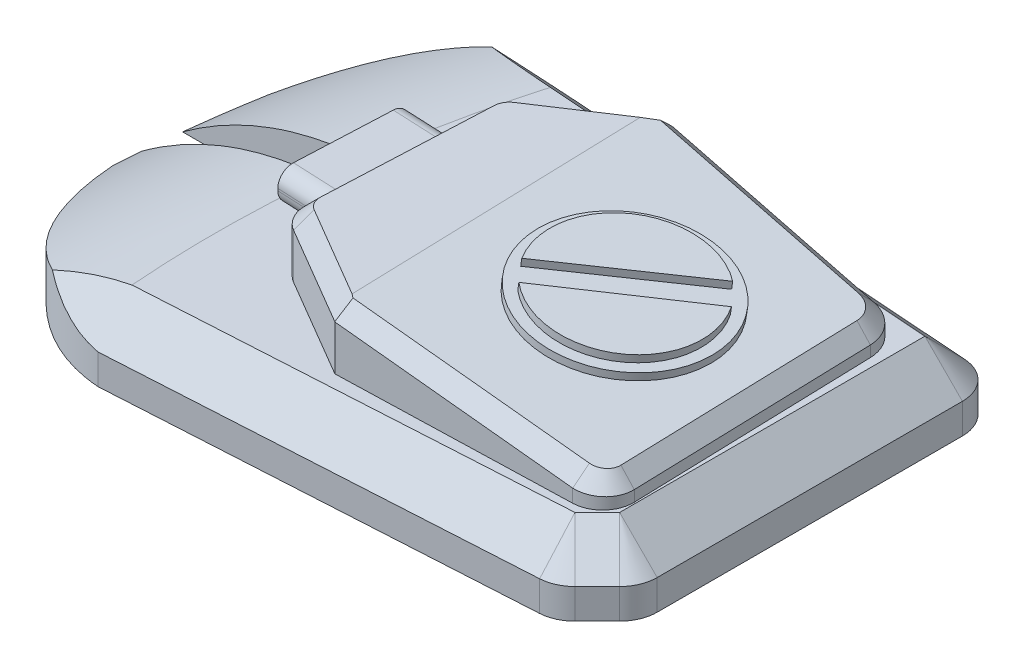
ISO-10303-21;
HEADER;
FILE_DESCRIPTION(('STEP AP214'),'2;1');
FILE_NAME('part.step','',(''),(''),'','','');
FILE_SCHEMA(('AUTOMOTIVE_DESIGN { 1 0 10303 214 1 1 1 1 }'));
ENDSEC;
DATA;
#1=APPLICATION_CONTEXT('core data for automotive mechanical design processes');
#2=APPLICATION_PROTOCOL_DEFINITION('international standard','automotive_design',2000,#1);
#3=PRODUCT_CONTEXT('',#1,'mechanical');
#4=PRODUCT('Part','Part','',(#3));
#5=PRODUCT_RELATED_PRODUCT_CATEGORY('part','',(#4));
#6=PRODUCT_DEFINITION_FORMATION('','',#4);
#7=PRODUCT_DEFINITION_CONTEXT('part definition',#1,'design');
#8=PRODUCT_DEFINITION('design','',#6,#7);
#9=PRODUCT_DEFINITION_SHAPE('','',#8);
#10=(LENGTH_UNIT() NAMED_UNIT(*) SI_UNIT(.MILLI.,.METRE.));
#11=(NAMED_UNIT(*) PLANE_ANGLE_UNIT() SI_UNIT($,.RADIAN.));
#12=(NAMED_UNIT(*) SI_UNIT($,.STERADIAN.) SOLID_ANGLE_UNIT());
#13=UNCERTAINTY_MEASURE_WITH_UNIT(LENGTH_MEASURE(1.E-05),#10,'distance_accuracy_value','');
#14=(GEOMETRIC_REPRESENTATION_CONTEXT(3) GLOBAL_UNCERTAINTY_ASSIGNED_CONTEXT((#13)) GLOBAL_UNIT_ASSIGNED_CONTEXT((#10,
#11,#12)) REPRESENTATION_CONTEXT('',''));
#15=CARTESIAN_POINT('',(0.,0.,0.));
#16=DIRECTION('',(0.,0.,1.));
#17=DIRECTION('',(1.,0.,0.));
#18=AXIS2_PLACEMENT_3D('',#15,#16,#17);
#19=CARTESIAN_POINT('',(-56.3344788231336,17.,-22.2287399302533));
#20=DIRECTION('',(-0.136411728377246,-0.990643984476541,0.00404182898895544));
#21=DIRECTION('',(0.990652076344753,-0.136412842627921,0.));
#22=AXIS2_PLACEMENT_3D('',#19,#20,#21);
#23=PLANE('',#22);
#24=CARTESIAN_POINT('',(-38.5244259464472,14.6571562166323,4.63434485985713));
#25=DIRECTION('',(-0.136411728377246,-0.990643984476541,0.00404182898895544));
#26=DIRECTION('',(0.990652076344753,-0.136412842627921,0.));
#27=AXIS2_PLACEMENT_3D('',#24,#25,#26);
#28=CIRCLE('',#27,11.6274931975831);
#29=CARTESIAN_POINT('',(-27.0056256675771,13.0710168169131,4.63434485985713));
#30=VERTEX_POINT('',#29);
#31=EDGE_CURVE('E372',#30,#30,#28,.F.);
#32=ORIENTED_EDGE('',*,*,#31,.F.);
#33=EDGE_LOOP('',(#32));
#34=FACE_BOUND('',#33,.T.);
#35=DIRECTION('',(-0.986384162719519,0.135444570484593,-0.0932794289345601));
#36=VECTOR('',#35,1.);
#37=CARTESIAN_POINT('',(-56.8579415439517,17.0952292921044,-16.5551028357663));
#38=LINE('',#37,#36);
#39=CARTESIAN_POINT('',(-25.5716580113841,12.7991777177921,-13.5964516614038));
#40=VERTEX_POINT('',#39);
#41=CARTESIAN_POINT('',(-54.6542015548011,16.7926244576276,-16.3467016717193));
#42=VERTEX_POINT('',#41);
#43=EDGE_CURVE('E725',#40,#42,#38,.T.);
#44=ORIENTED_EDGE('',*,*,#43,.T.);
#45=DIRECTION('',(-0.765331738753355,0.107975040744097,0.634514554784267));
#46=VECTOR('',#45,1.);
#47=CARTESIAN_POINT('',(-39.0741534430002,14.5945497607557,-29.2636719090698));
#48=LINE('',#47,#46);
#49=CARTESIAN_POINT('',(-56.1240883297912,17.,-15.1280607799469));
#50=VERTEX_POINT('',#49);
#51=EDGE_CURVE('E733',#42,#50,#48,.T.);
#52=ORIENTED_EDGE('',*,*,#51,.T.);
#53=DIRECTION('',(0.0296166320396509,0.,0.999561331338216));
#54=VECTOR('',#53,1.);
#55=CARTESIAN_POINT('',(-55.9637795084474,17.,-9.71763805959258));
#56=LINE('',#55,#54);
#57=CARTESIAN_POINT('',(-54.9531883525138,17.,24.3898134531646));
#58=VERTEX_POINT('',#57);
#59=EDGE_CURVE('E790',#50,#58,#56,.T.);
#60=ORIENTED_EDGE('',*,*,#59,.T.);
#61=DIRECTION('',(0.798057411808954,-0.107473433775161,0.592919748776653));
#62=VECTOR('',#61,1.);
#63=CARTESIAN_POINT('',(-49.3115086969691,16.2402417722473,28.5813205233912));
#64=LINE('',#63,#62);
#65=CARTESIAN_POINT('',(-54.4857359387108,16.9370487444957,24.737108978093));
#66=VERTEX_POINT('',#65);
#67=EDGE_CURVE('E795',#58,#66,#64,.T.);
#68=ORIENTED_EDGE('',*,*,#67,.T.);
#69=DIRECTION('',(0.990209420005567,-0.13647159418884,-0.0293395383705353));
#70=VECTOR('',#69,1.);
#71=CARTESIAN_POINT('',(-54.94249711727,17.,24.7506426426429));
#72=LINE('',#71,#70);
#73=CARTESIAN_POINT('',(-23.9306219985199,12.725914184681,23.831772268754));
#74=VERTEX_POINT('',#73);
#75=EDGE_CURVE('E798',#66,#74,#72,.T.);
#76=ORIENTED_EDGE('',*,*,#75,.T.);
#77=CARTESIAN_POINT('',(-21.8962508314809,12.4369740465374,21.6731646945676));
#78=CARTESIAN_POINT('',(-21.8921759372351,12.4369727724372,21.8103800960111));
#79=CARTESIAN_POINT('',(-21.9016337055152,12.4388365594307,21.9479907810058));
#80=CARTESIAN_POINT('',(-21.947197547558,12.4462153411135,22.218735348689));
#81=CARTESIAN_POINT('',(-21.9833109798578,12.4517313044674,22.3518582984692));
#82=CARTESIAN_POINT('',(-22.0808189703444,12.4662053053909,22.6085115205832));
#83=CARTESIAN_POINT('',(-22.1422094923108,12.4751627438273,22.7320311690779));
#84=CARTESIAN_POINT('',(-22.2879144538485,12.4961757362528,22.9647300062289));
#85=CARTESIAN_POINT('',(-22.372222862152,12.5082304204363,23.0738995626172));
#86=CARTESIAN_POINT('',(-22.5605254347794,12.534974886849,23.2737015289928));
#87=CARTESIAN_POINT('',(-22.6645118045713,12.5496635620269,23.3643256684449));
#88=CARTESIAN_POINT('',(-22.8881756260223,12.5811117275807,23.5235524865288));
#89=CARTESIAN_POINT('',(-23.0078438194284,12.5978699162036,23.5921485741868));
#90=CARTESIAN_POINT('',(-23.2582736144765,12.6328132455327,23.7046812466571));
#91=CARTESIAN_POINT('',(-23.3890248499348,12.6509969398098,23.7486131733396));
#92=CARTESIAN_POINT('',(-23.6565967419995,12.6880925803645,23.810127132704));
#93=CARTESIAN_POINT('',(-23.7934060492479,12.7070029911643,23.8277158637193));
#94=CARTESIAN_POINT('',(-23.9306219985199,12.725914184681,23.831772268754));
#95=B_SPLINE_CURVE_WITH_KNOTS('',3,(#77,#78,#79,#80,#81,#82,#83,#84,#85,#86,#87,#88,#89,#90,#91,
#92,#93,#94),.UNSPECIFIED.,.F.,.F.,(4,2,2,2,2,2,2,2,4),(6.28318530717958,6.47953484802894,
6.67588438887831,6.87223392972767,7.06858347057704,7.2649330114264,7.46128255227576,
7.65763209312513,7.85398163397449),.UNSPECIFIED.);
#96=CARTESIAN_POINT('',(-21.8962508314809,12.4369740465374,21.6731646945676));
#97=VERTEX_POINT('',#96);
#98=EDGE_CURVE('E800',#74,#97,#95,.F.);
#99=ORIENTED_EDGE('',*,*,#98,.T.);
#100=DIRECTION('',(-0.0296166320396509,0.,-0.999561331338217));
#101=VECTOR('',#100,1.);
#102=CARTESIAN_POINT('',(-23.2261143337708,12.4369740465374,-23.2097285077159));
#103=LINE('',#102,#101);
#104=CARTESIAN_POINT('',(-22.8554150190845,12.4369740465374,-10.6986266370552));
#105=VERTEX_POINT('',#104);
#106=EDGE_CURVE('E803',#97,#105,#103,.T.);
#107=ORIENTED_EDGE('',*,*,#106,.T.);
#108=CARTESIAN_POINT('',(-25.5716580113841,12.7991777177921,-13.5964516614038));
#109=CARTESIAN_POINT('',(-25.3915986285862,12.7744529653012,-13.5794335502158));
#110=CARTESIAN_POINT('',(-25.2130903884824,12.7500084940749,-13.546070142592));
#111=CARTESIAN_POINT('',(-24.8649729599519,12.7024736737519,-13.4477937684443));
#112=CARTESIAN_POINT('',(-24.6953750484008,12.6793849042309,-13.3828742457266));
#113=CARTESIAN_POINT('',(-24.3706133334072,12.6353151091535,-13.223582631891));
#114=CARTESIAN_POINT('',(-24.2154592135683,12.6143353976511,-13.1292152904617));
#115=CARTESIAN_POINT('',(-23.9246474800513,12.5751682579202,-12.9141047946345));
#116=CARTESIAN_POINT('',(-23.7889985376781,12.5569819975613,-12.7933680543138));
#117=CARTESIAN_POINT('',(-23.5416235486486,12.5239952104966,-12.5294559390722));
#118=CARTESIAN_POINT('',(-23.4299048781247,12.509195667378,-12.3862884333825));
#119=CARTESIAN_POINT('',(-23.2340364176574,12.4834653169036,-12.0821839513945));
#120=CARTESIAN_POINT('',(-23.1498924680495,12.4725352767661,-11.9212560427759));
#121=CARTESIAN_POINT('',(-23.0119200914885,12.4549007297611,-11.5868795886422));
#122=CARTESIAN_POINT('',(-22.9580957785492,12.4481967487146,-11.4134410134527));
#123=CARTESIAN_POINT('',(-22.8825203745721,12.4392332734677,-11.059700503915));
#124=CARTESIAN_POINT('',(-22.8607620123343,12.4369727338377,-10.8794093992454));
#125=CARTESIAN_POINT('',(-22.8554150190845,12.4369740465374,-10.6986266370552));
#126=B_SPLINE_CURVE_WITH_KNOTS('',3,(#108,#109,#110,#111,#112,#113,#114,#115,#116,#117,#118,
#119,#120,#121,#122,#123,#124,#125),.UNSPECIFIED.,.F.,.F.,(4,2,2,2,2,2,2,2,4),(4.83629658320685,
5.01715767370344,5.19801876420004,5.37887985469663,5.55974094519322,5.74060203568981,
5.92146312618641,6.102324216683,6.28318530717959),.UNSPECIFIED.);
#127=EDGE_CURVE('E734',#105,#40,#126,.F.);
#128=ORIENTED_EDGE('',*,*,#127,.T.);
#129=EDGE_LOOP('',(#44,#52,#60,#68,#76,#99,#107,#128));
#130=FACE_BOUND('',#129,.T.);
#131=ADVANCED_FACE('F47',(#34,#130),#23,.F.);
#132=CARTESIAN_POINT('',(-70.2053116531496,17.,15.223712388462));
#133=DIRECTION('',(0.998968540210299,0.,0.0454076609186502));
#134=DIRECTION('',(0.0454076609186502,0.,-0.9989685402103));
#135=AXIS2_PLACEMENT_3D('',#132,#133,#134);
#136=PLANE('',#135);
#137=DIRECTION('',(0.,-1.,0.));
#138=VECTOR('',#137,1.);
#139=CARTESIAN_POINT('',(-70.2053116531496,17.,15.223712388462));
#140=LINE('',#139,#138);
#141=CARTESIAN_POINT('',(-70.2053116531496,15.,15.223712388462));
#142=VERTEX_POINT('',#141);
#143=CARTESIAN_POINT('',(-70.2053116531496,8.99999999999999,15.223712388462));
#144=VERTEX_POINT('',#143);
#145=EDGE_CURVE('E777',#142,#144,#140,.T.);
#146=ORIENTED_EDGE('',*,*,#145,.F.);
#147=DIRECTION('',(0.0454076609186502,0.,-0.9989685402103));
#148=VECTOR('',#147,1.);
#149=CARTESIAN_POINT('',(-69.2009823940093,15.,-6.87153131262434));
#150=LINE('',#149,#148);
#151=CARTESIAN_POINT('',(-69.2009823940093,15.,-6.87153131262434));
#152=VERTEX_POINT('',#151);
#153=EDGE_CURVE('E758',#142,#152,#150,.T.);
#154=ORIENTED_EDGE('',*,*,#153,.T.);
#155=DIRECTION('',(0.,-1.,0.));
#156=VECTOR('',#155,1.);
#157=CARTESIAN_POINT('',(-69.2009823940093,17.,-6.87153131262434));
#158=LINE('',#157,#156);
#159=CARTESIAN_POINT('',(-69.2009823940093,8.99999999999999,-6.87153131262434));
#160=VERTEX_POINT('',#159);
#161=EDGE_CURVE('E779',#152,#160,#158,.T.);
#162=ORIENTED_EDGE('',*,*,#161,.T.);
#163=DIRECTION('',(-0.0454076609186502,0.,0.9989685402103));
#164=VECTOR('',#163,1.);
#165=CARTESIAN_POINT('',(-70.2053116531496,8.99999999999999,15.223712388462));
#166=LINE('',#165,#164);
#167=EDGE_CURVE('E511',#160,#144,#166,.T.);
#168=ORIENTED_EDGE('',*,*,#167,.T.);
#169=EDGE_LOOP('',(#146,#154,#162,#168));
#170=FACE_BOUND('',#169,.T.);
#171=CARTESIAN_POINT('',(-69.4119549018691,11.9853319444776,-2.23013613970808));
#172=DIRECTION('',(-0.9989685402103,0.,-0.0454076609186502));
#173=DIRECTION('',(-0.0454076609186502,0.,0.9989685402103));
#174=AXIS2_PLACEMENT_3D('',#171,#172,#173);
#175=CIRCLE('',#174,2.);
#176=CARTESIAN_POINT('',(-69.4119549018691,13.9853319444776,-2.23013613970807));
#177=VERTEX_POINT('',#176);
#178=CARTESIAN_POINT('',(-69.3211395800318,11.9853319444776,-4.22807322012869));
#179=VERTEX_POINT('',#178);
#180=EDGE_CURVE('E432',#177,#179,#175,.T.);
#181=ORIENTED_EDGE('',*,*,#180,.F.);
#182=DIRECTION('',(0.0454076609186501,0.,-0.998968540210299));
#183=VECTOR('',#182,1.);
#184=CARTESIAN_POINT('',(-69.4119549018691,13.9853319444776,-2.23013613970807));
#185=LINE('',#184,#183);
#186=CARTESIAN_POINT('',(-69.9894881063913,13.9853319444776,10.4755943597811));
#187=VERTEX_POINT('',#186);
#188=EDGE_CURVE('E437',#187,#177,#185,.T.);
#189=ORIENTED_EDGE('',*,*,#188,.F.);
#190=CARTESIAN_POINT('',(-69.9894881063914,11.9853319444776,10.4755943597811));
#191=DIRECTION('',(-0.9989685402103,0.,-0.0454076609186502));
#192=DIRECTION('',(0.0454076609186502,0.,-0.9989685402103));
#193=AXIS2_PLACEMENT_3D('',#190,#191,#192);
#194=CIRCLE('',#193,2.);
#195=CARTESIAN_POINT('',(-70.0803034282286,11.9853319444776,12.4735314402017));
#196=VERTEX_POINT('',#195);
#197=EDGE_CURVE('E469',#196,#187,#194,.T.);
#198=ORIENTED_EDGE('',*,*,#197,.F.);
#199=DIRECTION('',(0.,1.,0.));
#200=VECTOR('',#199,1.);
#201=CARTESIAN_POINT('',(-70.0803034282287,11.7084169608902,12.4735314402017));
#202=LINE('',#201,#200);
#203=CARTESIAN_POINT('',(-70.0803034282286,11.7084169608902,12.4735314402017));
#204=VERTEX_POINT('',#203);
#205=EDGE_CURVE('E466',#204,#196,#202,.T.);
#206=ORIENTED_EDGE('',*,*,#205,.F.);
#207=CARTESIAN_POINT('',(-69.9894881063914,11.7084169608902,10.4755943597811));
#208=DIRECTION('',(-0.9989685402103,0.,-0.0454076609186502));
#209=DIRECTION('',(-0.0454076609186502,0.,0.9989685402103));
#210=AXIS2_PLACEMENT_3D('',#207,#208,#209);
#211=CIRCLE('',#210,2.);
#212=CARTESIAN_POINT('',(-69.9894881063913,9.70841696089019,10.4755943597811));
#213=VERTEX_POINT('',#212);
#214=EDGE_CURVE('E463',#213,#204,#211,.T.);
#215=ORIENTED_EDGE('',*,*,#214,.F.);
#216=DIRECTION('',(-0.0454076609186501,0.,0.998968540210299));
#217=VECTOR('',#216,1.);
#218=CARTESIAN_POINT('',(-69.4119549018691,9.70841696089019,-2.23013613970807));
#219=LINE('',#218,#217);
#220=CARTESIAN_POINT('',(-69.4119549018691,9.70841696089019,-2.23013613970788));
#221=VERTEX_POINT('',#220);
#222=EDGE_CURVE('E460',#221,#213,#219,.T.);
#223=ORIENTED_EDGE('',*,*,#222,.F.);
#224=CARTESIAN_POINT('',(-69.4119549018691,11.7084169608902,-2.23013613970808));
#225=DIRECTION('',(-0.9989685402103,0.,-0.0454076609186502));
#226=DIRECTION('',(0.0454076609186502,0.,-0.9989685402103));
#227=AXIS2_PLACEMENT_3D('',#224,#225,#226);
#228=CIRCLE('',#227,2.);
#229=CARTESIAN_POINT('',(-69.3211395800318,11.7084169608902,-4.22807322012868));
#230=VERTEX_POINT('',#229);
#231=EDGE_CURVE('E457',#230,#221,#228,.T.);
#232=ORIENTED_EDGE('',*,*,#231,.F.);
#233=DIRECTION('',(0.,-1.,0.));
#234=VECTOR('',#233,1.);
#235=CARTESIAN_POINT('',(-69.3211395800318,11.7084169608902,-4.22807322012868));
#236=LINE('',#235,#234);
#237=EDGE_CURVE('E454',#179,#230,#236,.T.);
#238=ORIENTED_EDGE('',*,*,#237,.F.);
#239=EDGE_LOOP('',(#181,#189,#198,#206,#215,#223,#232,#238));
#240=FACE_BOUND('',#239,.T.);
#241=ADVANCED_FACE('F693',(#170,#240),#136,.F.);
#242=CARTESIAN_POINT('',(-95.2269179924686,8.99999999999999,24.054873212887));
#243=DIRECTION('',(0.,-1.,0.));
#244=DIRECTION('',(0.,0.,-1.));
#245=AXIS2_PLACEMENT_3D('',#242,#243,#244);
#246=PLANE('',#245);
#247=DIRECTION('',(0.,0.,-1.));
#248=VECTOR('',#247,1.);
#249=CARTESIAN_POINT('',(-19.9680754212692,8.99999999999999,24.054873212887));
#250=LINE('',#249,#248);
#251=CARTESIAN_POINT('',(-19.9680754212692,8.99999999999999,23.7752019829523));
#252=VERTEX_POINT('',#251);
#253=CARTESIAN_POINT('',(-19.9680754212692,8.99999999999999,-16.8418604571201));
#254=VERTEX_POINT('',#253);
#255=EDGE_CURVE('E1275',#252,#254,#250,.T.);
#256=ORIENTED_EDGE('',*,*,#255,.T.);
#257=DIRECTION('',(-0.997562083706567,0.,-0.0697845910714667));
#258=VECTOR('',#257,1.);
#259=CARTESIAN_POINT('',(-92.0134116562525,8.99999999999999,-21.8818017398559));
#260=LINE('',#259,#258);
#261=CARTESIAN_POINT('',(-73.5614122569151,8.99999999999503,-20.5909896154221));
#262=VERTEX_POINT('',#261);
#263=EDGE_CURVE('E1254',#254,#262,#260,.T.);
#264=ORIENTED_EDGE('',*,*,#263,.T.);
#265=CARTESIAN_POINT('',(-78.0358816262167,8.99999999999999,35.9828573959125));
#266=CARTESIAN_POINT('',(-78.0752059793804,8.99999999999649,35.6489588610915));
#267=CARTESIAN_POINT('',(-78.1126748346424,9.00000000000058,35.3221857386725));
#268=CARTESIAN_POINT('',(-78.2922196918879,8.99999999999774,33.7094225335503));
#269=CARTESIAN_POINT('',(-78.4200439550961,9.00000000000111,32.4113940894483));
#270=CARTESIAN_POINT('',(-78.639537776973,8.99999999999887,29.8404014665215));
#271=CARTESIAN_POINT('',(-78.7324009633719,9.00000000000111,28.5567161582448));
#272=CARTESIAN_POINT('',(-78.9603393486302,8.99999999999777,24.7110932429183));
#273=CARTESIAN_POINT('',(-79.0447633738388,8.99999999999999,22.1545886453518));
#274=CARTESIAN_POINT('',(-79.0954307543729,8.99999999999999,14.5068068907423));
#275=CARTESIAN_POINT('',(-78.8590694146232,9.00000000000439,9.43726177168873));
#276=CARTESIAN_POINT('',(-77.3395666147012,8.9999999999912,-5.68444543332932));
#277=CARTESIAN_POINT('',(-75.2460063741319,8.99999999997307,-15.6496793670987));
#278=CARTESIAN_POINT('',(-71.9697128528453,9.00000000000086,-25.8160591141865));
#279=CARTESIAN_POINT('',(-71.8664182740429,8.99999999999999,-26.1329890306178));
#280=CARTESIAN_POINT('',(-71.7620739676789,8.99999999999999,-26.4498063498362));
#281=B_SPLINE_CURVE_WITH_KNOTS('',3,(#265,#266,#267,#268,#269,#270,#271,#272,#273,#274,#275,
#276,#277,#278,#279,#280),.UNSPECIFIED.,.F.,.F.,(4,2,2,2,2,2,2,4),(0.,0.0158332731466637,
0.0763693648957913,0.136905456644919,0.257977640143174,0.500122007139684,0.984410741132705,1.),.UNSPECIFIED.);
#282=CARTESIAN_POINT('',(-78.1498965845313,8.99999999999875,2.50723389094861));
#283=VERTEX_POINT('',#282);
#284=EDGE_CURVE('E1071',#283,#262,#281,.T.);
#285=ORIENTED_EDGE('',*,*,#284,.F.);
#286=CARTESIAN_POINT('',(-78.6210986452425,8.99999999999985,30.0068441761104));
#287=VERTEX_POINT('',#286);
#288=EDGE_CURVE('E52',#287,#283,#281,.T.);
#289=ORIENTED_EDGE('',*,*,#288,.F.);
#290=DIRECTION('',(0.99829078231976,0.,-0.0584423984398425));
#291=VECTOR('',#290,1.);
#292=CARTESIAN_POINT('',(-94.8229476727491,8.99999999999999,30.9553402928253));
#293=LINE('',#292,#291);
#294=CARTESIAN_POINT('',(-22.9400096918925,8.99999999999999,26.7471362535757));
#295=VERTEX_POINT('',#294);
#296=EDGE_CURVE('E1276',#287,#295,#293,.T.);
#297=ORIENTED_EDGE('',*,*,#296,.T.);
#298=DIRECTION('',(0.707106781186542,0.,-0.707106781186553));
#299=VECTOR('',#298,1.);
#300=CARTESIAN_POINT('',(-57.7373323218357,8.99999999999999,61.5444588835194));
#301=LINE('',#300,#299);
#302=EDGE_CURVE('E1273',#295,#252,#301,.T.);
#303=ORIENTED_EDGE('',*,*,#302,.T.);
#304=EDGE_LOOP('',(#256,#264,#285,#289,#297,#303));
#305=FACE_BOUND('',#304,.T.);
#306=CARTESIAN_POINT('',(-26.1269224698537,8.99999999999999,-10.6016930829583));
#307=DIRECTION('',(0.,1.,0.));
#308=DIRECTION('',(0.,0.,1.));
#309=AXIS2_PLACEMENT_3D('',#306,#307,#308);
#310=CIRCLE('',#309,5.);
#311=CARTESIAN_POINT('',(-21.1291158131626,8.99999999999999,-10.7497762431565));
#312=VERTEX_POINT('',#311);
#313=CARTESIAN_POINT('',(-25.6561874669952,8.99999999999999,-15.579484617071));
#314=VERTEX_POINT('',#313);
#315=EDGE_CURVE('E498',#312,#314,#310,.T.);
#316=ORIENTED_EDGE('',*,*,#315,.F.);
#317=DIRECTION('',(-0.0296166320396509,0.,-0.999561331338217));
#318=VECTOR('',#317,1.);
#319=CARTESIAN_POINT('',(-21.1291158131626,8.99999999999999,-10.7497762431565));
#320=LINE('',#319,#318);
#321=CARTESIAN_POINT('',(-20.1699516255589,8.99999999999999,21.6220150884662));
#322=VERTEX_POINT('',#321);
#323=EDGE_CURVE('E526',#322,#312,#320,.T.);
#324=ORIENTED_EDGE('',*,*,#323,.F.);
#325=CARTESIAN_POINT('',(-24.2655636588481,8.99999999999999,21.7433665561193));
#326=DIRECTION('',(0.,1.,0.));
#327=DIRECTION('',(0.,0.,1.));
#328=AXIS2_PLACEMENT_3D('',#325,#326,#327);
#329=CIRCLE('',#328,4.09740943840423);
#330=CARTESIAN_POINT('',(-24.1442121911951,8.99999999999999,25.8389785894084));
#331=VERTEX_POINT('',#330);
#332=EDGE_CURVE('E523',#331,#322,#329,.T.);
#333=ORIENTED_EDGE('',*,*,#332,.F.);
#334=DIRECTION('',(0.999561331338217,0.,-0.0296166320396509));
#335=VECTOR('',#334,1.);
#336=CARTESIAN_POINT('',(-24.1442121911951,8.99999999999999,25.8389785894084));
#337=LINE('',#336,#335);
#338=CARTESIAN_POINT('',(-54.8832638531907,8.99999999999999,26.7497653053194));
#339=VERTEX_POINT('',#338);
#340=EDGE_CURVE('E520',#339,#331,#337,.T.);
#341=ORIENTED_EDGE('',*,*,#340,.F.);
#342=DIRECTION('',(0.862470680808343,0.,0.506107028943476));
#343=VECTOR('',#342,1.);
#344=CARTESIAN_POINT('',(-54.8832638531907,8.99999999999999,26.7497653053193));
#345=LINE('',#344,#343);
#346=CARTESIAN_POINT('',(-68.1858562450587,8.99999999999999,18.9436616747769));
#347=VERTEX_POINT('',#346);
#348=EDGE_CURVE('E517',#347,#339,#345,.T.);
#349=ORIENTED_EDGE('',*,*,#348,.F.);
#350=CARTESIAN_POINT('',(-66.112128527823,8.99999999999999,15.4097661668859));
#351=DIRECTION('',(0.,1.,0.));
#352=DIRECTION('',(0.,0.,-1.));
#353=AXIS2_PLACEMENT_3D('',#350,#351,#352);
#354=CIRCLE('',#353,4.09740943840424);
#355=EDGE_CURVE('E514',#144,#347,#354,.T.);
#356=ORIENTED_EDGE('',*,*,#355,.F.);
#357=ORIENTED_EDGE('',*,*,#167,.F.);
#358=CARTESIAN_POINT('',(-65.1077992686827,8.99999999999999,-6.68547753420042));
#359=DIRECTION('',(0.,1.,0.));
#360=DIRECTION('',(0.,0.,1.));
#361=AXIS2_PLACEMENT_3D('',#358,#359,#360);
#362=CIRCLE('',#361,4.09740943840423);
#363=CARTESIAN_POINT('',(-67.3648936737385,8.99999999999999,-10.1051688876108));
#364=VERTEX_POINT('',#363);
#365=EDGE_CURVE('E508',#364,#160,#362,.T.);
#366=ORIENTED_EDGE('',*,*,#365,.F.);
#367=DIRECTION('',(-0.834598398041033,0.,0.550858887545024));
#368=VECTOR('',#367,1.);
#369=CARTESIAN_POINT('',(-67.3648936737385,8.99999999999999,-10.1051688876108));
#370=LINE('',#369,#368);
#371=CARTESIAN_POINT('',(-54.8832638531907,8.99999999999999,-18.3434026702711));
#372=VERTEX_POINT('',#371);
#373=EDGE_CURVE('E505',#372,#364,#370,.T.);
#374=ORIENTED_EDGE('',*,*,#373,.F.);
#375=DIRECTION('',(-0.995558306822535,0.,-0.0941470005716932));
#376=VECTOR('',#375,1.);
#377=CARTESIAN_POINT('',(-54.8832638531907,8.99999999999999,-18.343402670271));
#378=LINE('',#377,#376);
#379=EDGE_CURVE('E501',#314,#372,#378,.T.);
#380=ORIENTED_EDGE('',*,*,#379,.F.);
#381=EDGE_LOOP('',(#316,#324,#333,#341,#349,#356,#357,#366,#374,#380));
#382=FACE_BOUND('',#381,.T.);
#383=ADVANCED_FACE('F700',(#305,#382),#246,.F.);
#384=CARTESIAN_POINT('',(-22.6477976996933,8.99999999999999,31.7385901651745));
#385=DIRECTION('',(-0.0584423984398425,0.,-0.99829078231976));
#386=DIRECTION('',(-0.99829078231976,0.,0.0584423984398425));
#387=AXIS2_PLACEMENT_3D('',#384,#385,#386);
#388=PLANE('',#387);
#389=DIRECTION('',(0.,-1.,0.));
#390=VECTOR('',#389,1.);
#391=CARTESIAN_POINT('',(-22.6477976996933,8.99999999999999,31.7385901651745));
#392=LINE('',#391,#390);
#393=CARTESIAN_POINT('',(-22.6477976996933,3.99999999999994,31.7385901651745));
#394=VERTEX_POINT('',#393);
#395=CARTESIAN_POINT('',(-22.6477976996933,0.,31.7385901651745));
#396=VERTEX_POINT('',#395);
#397=EDGE_CURVE('E1154',#394,#396,#392,.T.);
#398=ORIENTED_EDGE('',*,*,#397,.F.);
#399=DIRECTION('',(-0.99829078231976,0.,0.0584423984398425));
#400=VECTOR('',#399,1.);
#401=CARTESIAN_POINT('',(-22.6477976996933,3.99999999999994,31.7385901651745));
#402=LINE('',#401,#400);
#403=CARTESIAN_POINT('',(-78.149898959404,3.99999999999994,34.9878197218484));
#404=VERTEX_POINT('',#403);
#405=EDGE_CURVE('E73',#394,#404,#402,.T.);
#406=ORIENTED_EDGE('',*,*,#405,.T.);
#407=DIRECTION('',(0.,-1.,0.));
#408=VECTOR('',#407,1.);
#409=CARTESIAN_POINT('',(-78.149898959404,8.99999999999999,34.9878197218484));
#410=LINE('',#409,#408);
#411=CARTESIAN_POINT('',(-78.149898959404,0.,34.9878197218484));
#412=VERTEX_POINT('',#411);
#413=EDGE_CURVE('E1113',#404,#412,#410,.T.);
#414=ORIENTED_EDGE('',*,*,#413,.T.);
#415=DIRECTION('',(0.99829078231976,0.,-0.0584423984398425));
#416=VECTOR('',#415,1.);
#417=CARTESIAN_POINT('',(-22.6477976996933,0.,31.7385901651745));
#418=LINE('',#417,#416);
#419=EDGE_CURVE('E789',#412,#396,#418,.T.);
#420=ORIENTED_EDGE('',*,*,#419,.T.);
#421=EDGE_LOOP('',(#398,#406,#414,#420));
#422=FACE_BOUND('',#421,.T.);
#423=ADVANCED_FACE('F572',(#422),#388,.F.);
#424=CARTESIAN_POINT('',(-22.9400096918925,8.99999999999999,26.7471362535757));
#425=DIRECTION('',(0.,-1.,0.));
#426=DIRECTION('',(0.,0.,-1.));
#427=AXIS2_PLACEMENT_3D('',#424,#425,#426);
#428=CYLINDRICAL_SURFACE('',#427,5.);
#429=DIRECTION('',(0.,-1.,0.));
#430=VECTOR('',#429,1.);
#431=CARTESIAN_POINT('',(-19.4044757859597,8.99999999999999,30.2826701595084));
#432=LINE('',#431,#430);
#433=CARTESIAN_POINT('',(-19.4044757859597,3.99999999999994,30.2826701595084));
#434=VERTEX_POINT('',#433);
#435=CARTESIAN_POINT('',(-19.4044757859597,0.,30.2826701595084));
#436=VERTEX_POINT('',#435);
#437=EDGE_CURVE('E1157',#434,#436,#432,.T.);
#438=ORIENTED_EDGE('',*,*,#437,.F.);
#439=CARTESIAN_POINT('',(-22.9400096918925,3.99999999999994,26.7471362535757));
#440=DIRECTION('',(0.,-1.,0.));
#441=DIRECTION('',(0.,0.,-1.));
#442=AXIS2_PLACEMENT_3D('',#439,#440,#441);
#443=CIRCLE('',#442,5.);
#444=EDGE_CURVE('E1112',#434,#394,#443,.T.);
#445=ORIENTED_EDGE('',*,*,#444,.T.);
#446=ORIENTED_EDGE('',*,*,#397,.T.);
#447=CARTESIAN_POINT('',(-22.9400096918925,0.,26.7471362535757));
#448=DIRECTION('',(0.,1.,0.));
#449=DIRECTION('',(0.,0.,1.));
#450=AXIS2_PLACEMENT_3D('',#447,#448,#449);
#451=CIRCLE('',#450,5.);
#452=EDGE_CURVE('E1115',#396,#436,#451,.T.);
#453=ORIENTED_EDGE('',*,*,#452,.T.);
#454=EDGE_LOOP('',(#438,#445,#446,#453));
#455=FACE_BOUND('',#454,.T.);
#456=ADVANCED_FACE('F1267',(#455),#428,.T.);
#457=CARTESIAN_POINT('',(-16.4325415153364,8.99999999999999,27.310735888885));
#458=DIRECTION('',(-0.707106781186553,0.,-0.707106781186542));
#459=DIRECTION('',(-0.707106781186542,0.,0.707106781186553));
#460=AXIS2_PLACEMENT_3D('',#457,#458,#459);
#461=PLANE('',#460);
#462=DIRECTION('',(0.,-1.,0.));
#463=VECTOR('',#462,1.);
#464=CARTESIAN_POINT('',(-16.4325415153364,8.99999999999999,27.310735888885));
#465=LINE('',#464,#463);
#466=CARTESIAN_POINT('',(-16.4325415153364,3.99999999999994,27.310735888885));
#467=VERTEX_POINT('',#466);
#468=CARTESIAN_POINT('',(-16.4325415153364,0.,27.310735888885));
#469=VERTEX_POINT('',#468);
#470=EDGE_CURVE('E1160',#467,#469,#465,.T.);
#471=ORIENTED_EDGE('',*,*,#470,.F.);
#472=DIRECTION('',(-0.707106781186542,0.,0.707106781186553));
#473=VECTOR('',#472,1.);
#474=CARTESIAN_POINT('',(-16.4325415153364,3.99999999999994,27.310735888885));
#475=LINE('',#474,#473);
#476=EDGE_CURVE('E1260',#467,#434,#475,.T.);
#477=ORIENTED_EDGE('',*,*,#476,.T.);
#478=ORIENTED_EDGE('',*,*,#437,.T.);
#479=DIRECTION('',(0.707106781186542,0.,-0.707106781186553));
#480=VECTOR('',#479,1.);
#481=CARTESIAN_POINT('',(-16.4325415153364,0.,27.310735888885));
#482=LINE('',#481,#480);
#483=EDGE_CURVE('E1156',#436,#469,#482,.T.);
#484=ORIENTED_EDGE('',*,*,#483,.T.);
#485=EDGE_LOOP('',(#471,#477,#478,#484));
#486=FACE_BOUND('',#485,.T.);
#487=ADVANCED_FACE('F1301',(#486),#461,.F.);
#488=CARTESIAN_POINT('',(-19.9680754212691,8.99999999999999,23.7752019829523));
#489=DIRECTION('',(0.,-1.,0.));
#490=DIRECTION('',(0.,0.,-1.));
#491=AXIS2_PLACEMENT_3D('',#488,#489,#490);
#492=CYLINDRICAL_SURFACE('',#491,5.);
#493=DIRECTION('',(0.,-1.,0.));
#494=VECTOR('',#493,1.);
#495=CARTESIAN_POINT('',(-14.9680754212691,8.99999999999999,23.7752019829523));
#496=LINE('',#495,#494);
#497=CARTESIAN_POINT('',(-14.9680754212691,3.99999999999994,23.7752019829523));
#498=VERTEX_POINT('',#497);
#499=CARTESIAN_POINT('',(-14.9680754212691,0.,23.7752019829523));
#500=VERTEX_POINT('',#499);
#501=EDGE_CURVE('E1163',#498,#500,#496,.T.);
#502=ORIENTED_EDGE('',*,*,#501,.F.);
#503=CARTESIAN_POINT('',(-19.9680754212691,3.99999999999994,23.7752019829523));
#504=DIRECTION('',(0.,-1.,0.));
#505=DIRECTION('',(0.,0.,-1.));
#506=AXIS2_PLACEMENT_3D('',#503,#504,#505);
#507=CIRCLE('',#506,5.);
#508=EDGE_CURVE('E1259',#498,#467,#507,.T.);
#509=ORIENTED_EDGE('',*,*,#508,.T.);
#510=ORIENTED_EDGE('',*,*,#470,.T.);
#511=CARTESIAN_POINT('',(-19.9680754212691,0.,23.7752019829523));
#512=DIRECTION('',(0.,1.,0.));
#513=DIRECTION('',(0.,0.,1.));
#514=AXIS2_PLACEMENT_3D('',#511,#512,#513);
#515=CIRCLE('',#514,5.);
#516=EDGE_CURVE('E1159',#469,#500,#515,.T.);
#517=ORIENTED_EDGE('',*,*,#516,.T.);
#518=EDGE_LOOP('',(#502,#509,#510,#517));
#519=FACE_BOUND('',#518,.T.);
#520=ADVANCED_FACE('F1300',(#519),#492,.T.);
#521=CARTESIAN_POINT('',(-14.9680754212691,8.99999999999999,-16.8418604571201));
#522=DIRECTION('',(-1.,0.,0.));
#523=DIRECTION('',(0.,0.,1.));
#524=AXIS2_PLACEMENT_3D('',#521,#522,#523);
#525=PLANE('',#524);
#526=DIRECTION('',(0.,-1.,0.));
#527=VECTOR('',#526,1.);
#528=CARTESIAN_POINT('',(-14.9680754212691,8.99999999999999,-16.8418604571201));
#529=LINE('',#528,#527);
#530=CARTESIAN_POINT('',(-14.9680754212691,3.99999999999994,-16.8418604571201));
#531=VERTEX_POINT('',#530);
#532=CARTESIAN_POINT('',(-14.9680754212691,0.,-16.8418604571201));
#533=VERTEX_POINT('',#532);
#534=EDGE_CURVE('E1166',#531,#533,#529,.T.);
#535=ORIENTED_EDGE('',*,*,#534,.F.);
#536=DIRECTION('',(0.,0.,1.));
#537=VECTOR('',#536,1.);
#538=CARTESIAN_POINT('',(-14.9680754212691,3.99999999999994,-16.8418604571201));
#539=LINE('',#538,#537);
#540=EDGE_CURVE('E1257',#531,#498,#539,.T.);
#541=ORIENTED_EDGE('',*,*,#540,.T.);
#542=ORIENTED_EDGE('',*,*,#501,.T.);
#543=DIRECTION('',(0.,0.,-1.));
#544=VECTOR('',#543,1.);
#545=CARTESIAN_POINT('',(-14.9680754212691,0.,-16.8418604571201));
#546=LINE('',#545,#544);
#547=EDGE_CURVE('E1162',#500,#533,#546,.T.);
#548=ORIENTED_EDGE('',*,*,#547,.T.);
#549=EDGE_LOOP('',(#535,#541,#542,#548));
#550=FACE_BOUND('',#549,.T.);
#551=ADVANCED_FACE('F1294',(#550),#525,.F.);
#552=CARTESIAN_POINT('',(-19.9680754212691,8.99999999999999,-16.8418604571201));
#553=DIRECTION('',(0.,-1.,0.));
#554=DIRECTION('',(0.,0.,-1.));
#555=AXIS2_PLACEMENT_3D('',#552,#553,#554);
#556=CYLINDRICAL_SURFACE('',#555,5.);
#557=DIRECTION('',(0.,-1.,0.));
#558=VECTOR('',#557,1.);
#559=CARTESIAN_POINT('',(-19.6191524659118,8.99999999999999,-21.8296708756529));
#560=LINE('',#559,#558);
#561=CARTESIAN_POINT('',(-19.6191524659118,3.99999999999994,-21.8296708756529));
#562=VERTEX_POINT('',#561);
#563=CARTESIAN_POINT('',(-19.6191524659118,0.,-21.8296708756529));
#564=VERTEX_POINT('',#563);
#565=EDGE_CURVE('E1169',#562,#564,#560,.T.);
#566=ORIENTED_EDGE('',*,*,#565,.F.);
#567=CARTESIAN_POINT('',(-19.9680754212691,3.99999999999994,-16.8418604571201));
#568=DIRECTION('',(0.,-1.,0.));
#569=DIRECTION('',(0.,0.,-1.));
#570=AXIS2_PLACEMENT_3D('',#567,#568,#569);
#571=CIRCLE('',#570,5.);
#572=EDGE_CURVE('E1252',#562,#531,#571,.T.);
#573=ORIENTED_EDGE('',*,*,#572,.T.);
#574=ORIENTED_EDGE('',*,*,#534,.T.);
#575=CARTESIAN_POINT('',(-19.9680754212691,0.,-16.8418604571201));
#576=DIRECTION('',(0.,1.,0.));
#577=DIRECTION('',(0.,0.,1.));
#578=AXIS2_PLACEMENT_3D('',#575,#576,#577);
#579=CIRCLE('',#578,5.);
#580=EDGE_CURVE('E1165',#533,#564,#579,.T.);
#581=ORIENTED_EDGE('',*,*,#580,.T.);
#582=EDGE_LOOP('',(#566,#573,#574,#581));
#583=FACE_BOUND('',#582,.T.);
#584=ADVANCED_FACE('F1291',(#583),#556,.T.);
#585=CARTESIAN_POINT('',(-72.0718877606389,8.99999999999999,-25.4990090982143));
#586=DIRECTION('',(-0.0697845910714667,0.,0.997562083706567));
#587=DIRECTION('',(0.997562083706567,0.,0.0697845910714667));
#588=AXIS2_PLACEMENT_3D('',#585,#586,#587);
#589=PLANE('',#588);
#590=DIRECTION('',(0.,-1.,0.));
#591=VECTOR('',#590,1.);
#592=CARTESIAN_POINT('',(-72.0718877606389,8.99999999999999,-25.4990090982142));
#593=LINE('',#592,#591);
#594=CARTESIAN_POINT('',(-72.0718877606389,3.99999999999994,-25.4990090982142));
#595=VERTEX_POINT('',#594);
#596=CARTESIAN_POINT('',(-72.0718877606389,0.,-25.4990090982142));
#597=VERTEX_POINT('',#596);
#598=EDGE_CURVE('E658',#595,#597,#593,.T.);
#599=ORIENTED_EDGE('',*,*,#598,.F.);
#600=DIRECTION('',(0.997562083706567,0.,0.0697845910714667));
#601=VECTOR('',#600,1.);
#602=CARTESIAN_POINT('',(-72.0718877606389,3.99999999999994,-25.4990090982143));
#603=LINE('',#602,#601);
#604=EDGE_CURVE('E1251',#595,#562,#603,.T.);
#605=ORIENTED_EDGE('',*,*,#604,.T.);
#606=ORIENTED_EDGE('',*,*,#565,.T.);
#607=DIRECTION('',(-0.997562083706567,0.,-0.0697845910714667));
#608=VECTOR('',#607,1.);
#609=CARTESIAN_POINT('',(-72.0718877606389,0.,-25.4990090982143));
#610=LINE('',#609,#608);
#611=EDGE_CURVE('E1168',#564,#597,#610,.T.);
#612=ORIENTED_EDGE('',*,*,#611,.T.);
#613=EDGE_LOOP('',(#599,#605,#606,#612));
#614=FACE_BOUND('',#613,.T.);
#615=ADVANCED_FACE('F1306',(#614),#589,.F.);
#616=CARTESIAN_POINT('',(-95.2269179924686,0.,24.054873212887));
#617=DIRECTION('',(0.,-1.,0.));
#618=DIRECTION('',(0.,0.,-1.));
#619=AXIS2_PLACEMENT_3D('',#616,#617,#618);
#620=PLANE('',#619);
#621=CARTESIAN_POINT('',(-103.86516516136,0.,4.9258069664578));
#622=CARTESIAN_POINT('',(-100.032881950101,0.,16.9659251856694));
#623=CARTESIAN_POINT('',(-93.2338779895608,0.,33.875861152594));
#624=CARTESIAN_POINT('',(-78.149898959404,0.,34.9878197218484));
#625=B_SPLINE_CURVE_WITH_KNOTS('',3,(#621,#622,#623,#624),.UNSPECIFIED.,.F.,.F.,(4,4),(0.,1.),.UNSPECIFIED.);
#626=CARTESIAN_POINT('',(-102.648018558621,8.20997092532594E-13,8.5863802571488));
#627=VERTEX_POINT('',#626);
#628=EDGE_CURVE('E1153',#627,#412,#625,.T.);
#629=ORIENTED_EDGE('',*,*,#628,.F.);
#630=CARTESIAN_POINT('',(-101.900048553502,0.,37.5323352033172));
#631=CARTESIAN_POINT('',(-101.942571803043,9.81978998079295E-12,37.1491841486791));
#632=CARTESIAN_POINT('',(-101.983127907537,7.0540720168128E-13,36.772567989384));
#633=CARTESIAN_POINT('',(-102.177572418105,-2.69701625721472E-12,34.9052943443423));
#634=CARTESIAN_POINT('',(-102.314871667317,1.12060948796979E-12,33.4008279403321));
#635=CARTESIAN_POINT('',(-102.547863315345,-1.11893197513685E-12,30.418104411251));
#636=CARTESIAN_POINT('',(-102.644848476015,1.11467133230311E-12,28.92743128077));
#637=CARTESIAN_POINT('',(-102.877033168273,-2.23098942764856E-12,24.458059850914));
#638=CARTESIAN_POINT('',(-102.953445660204,0.,21.4820006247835));
#639=CARTESIAN_POINT('',(-102.946182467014,0.,12.5694214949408));
#640=CARTESIAN_POINT('',(-102.625706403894,2.00642185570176E-12,6.64847192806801));
#641=CARTESIAN_POINT('',(-100.716440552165,-4.05539428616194E-12,-11.0084722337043));
#642=CARTESIAN_POINT('',(-98.1760865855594,-1.96543259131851E-11,-22.6352330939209));
#643=CARTESIAN_POINT('',(-94.2971603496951,5.75588731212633E-13,-34.3826930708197));
#644=CARTESIAN_POINT('',(-94.1755210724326,0.,-34.7472627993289));
#645=CARTESIAN_POINT('',(-94.0533096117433,0.,-35.1100695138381));
#646=B_SPLINE_CURVE_WITH_KNOTS('',3,(#630,#631,#632,#633,#634,#635,#636,#637,#638,#639,#640,
#641,#642,#643,#644,#645),.UNSPECIFIED.,.F.,.F.,(4,2,2,2,2,2,2,4),(0.,0.0158332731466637,
0.0763693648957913,0.136905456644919,0.257977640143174,0.500122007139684,0.984410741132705,1.),.UNSPECIFIED.);
#647=CARTESIAN_POINT('',(-102.386278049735,8.20231310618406E-13,4.92580697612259));
#648=VERTEX_POINT('',#647);
#649=EDGE_CURVE('E1171',#627,#648,#646,.T.);
#650=ORIENTED_EDGE('',*,*,#649,.T.);
#651=DIRECTION('',(-1.,0.,0.));
#652=VECTOR('',#651,1.);
#653=CARTESIAN_POINT('',(-81.5773273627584,0.,4.9258069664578));
#654=LINE('',#653,#652);
#655=CARTESIAN_POINT('',(-81.5773273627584,0.,4.9258069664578));
#656=VERTEX_POINT('',#655);
#657=EDGE_CURVE('E1152',#656,#648,#654,.T.);
#658=ORIENTED_EDGE('',*,*,#657,.F.);
#659=DIRECTION('',(-0.817056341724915,0.,0.576557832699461));
#660=VECTOR('',#659,1.);
#661=CARTESIAN_POINT('',(-78.149898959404,0.,2.50723361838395));
#662=LINE('',#661,#660);
#663=CARTESIAN_POINT('',(-78.149898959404,0.,2.50723361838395));
#664=VERTEX_POINT('',#663);
#665=EDGE_CURVE('E1194',#664,#656,#662,.T.);
#666=ORIENTED_EDGE('',*,*,#665,.F.);
#667=DIRECTION('',(0.829110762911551,0.,0.559084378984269));
#668=VECTOR('',#667,1.);
#669=CARTESIAN_POINT('',(-81.8680754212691,0.,0.));
#670=LINE('',#669,#668);
#671=CARTESIAN_POINT('',(-81.8680754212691,0.,0.));
#672=VERTEX_POINT('',#671);
#673=EDGE_CURVE('E1174',#672,#664,#670,.T.);
#674=ORIENTED_EDGE('',*,*,#673,.F.);
#675=DIRECTION('',(1.,0.,0.));
#676=VECTOR('',#675,1.);
#677=CARTESIAN_POINT('',(-81.8680754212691,0.,0.));
#678=LINE('',#677,#676);
#679=CARTESIAN_POINT('',(-101.905002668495,-2.91854849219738E-13,8.94971710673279E-09));
#680=VERTEX_POINT('',#679);
#681=EDGE_CURVE('E1177',#680,#672,#678,.T.);
#682=ORIENTED_EDGE('',*,*,#681,.F.);
#683=CARTESIAN_POINT('',(-100.465167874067,0.,-10.0055644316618));
#684=VERTEX_POINT('',#683);
#685=EDGE_CURVE('E1175',#680,#684,#646,.T.);
#686=ORIENTED_EDGE('',*,*,#685,.T.);
#687=CARTESIAN_POINT('',(-74.1654254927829,0.,4.42785341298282));
#688=DIRECTION('',(0.,1.,0.));
#689=DIRECTION('',(0.,0.,1.));
#690=AXIS2_PLACEMENT_3D('',#687,#688,#689);
#691=CIRCLE('',#690,30.);
#692=EDGE_CURVE('E1178',#597,#684,#691,.T.);
#693=ORIENTED_EDGE('',*,*,#692,.F.);
#694=ORIENTED_EDGE('',*,*,#611,.F.);
#695=ORIENTED_EDGE('',*,*,#580,.F.);
#696=ORIENTED_EDGE('',*,*,#547,.F.);
#697=ORIENTED_EDGE('',*,*,#516,.F.);
#698=ORIENTED_EDGE('',*,*,#483,.F.);
#699=ORIENTED_EDGE('',*,*,#452,.F.);
#700=ORIENTED_EDGE('',*,*,#419,.F.);
#701=EDGE_LOOP('',(#629,#650,#658,#666,#674,#682,#686,#693,#694,#695,#696,#697,#698,#699,#700));
#702=FACE_BOUND('',#701,.T.);
#703=ADVANCED_FACE('F1135',(#702),#620,.T.);
#704=CARTESIAN_POINT('',(-81.8680754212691,8.99999999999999,0.));
#705=DIRECTION('',(0.559084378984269,0.,-0.829110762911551));
#706=DIRECTION('',(-0.829110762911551,0.,-0.559084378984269));
#707=AXIS2_PLACEMENT_3D('',#704,#705,#706);
#708=PLANE('',#707);
#709=CARTESIAN_POINT('',(-81.8680754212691,8.51284663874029,0.));
#710=CARTESIAN_POINT('',(-81.713832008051,8.5403857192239,0.104009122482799));
#711=CARTESIAN_POINT('',(-81.5594753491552,8.56700089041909,0.208094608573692));
#712=CARTESIAN_POINT('',(-81.2505953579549,8.61839014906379,0.4163779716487));
#713=CARTESIAN_POINT('',(-81.0960720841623,8.64316474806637,0.520575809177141));
#714=CARTESIAN_POINT('',(-80.7868608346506,8.69089058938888,0.729082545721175));
#715=CARTESIAN_POINT('',(-80.6321728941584,8.71384216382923,0.83339142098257));
#716=CARTESIAN_POINT('',(-80.32263417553,8.75793971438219,1.04211897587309));
#717=CARTESIAN_POINT('',(-80.1677834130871,8.77908585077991,1.14653764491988));
#718=CARTESIAN_POINT('',(-79.8579222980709,8.81958990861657,1.35548259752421));
#719=CARTESIAN_POINT('',(-79.7029119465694,8.83894784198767,1.46000888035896));
#720=CARTESIAN_POINT('',(-79.3927315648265,8.8758932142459,1.66916912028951));
#721=CARTESIAN_POINT('',(-79.2375615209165,8.89348048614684,1.77380308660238));
#722=CARTESIAN_POINT('',(-78.9270630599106,8.92690184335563,1.98317781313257));
#723=CARTESIAN_POINT('',(-78.7717346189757,8.94273560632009,2.08791858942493));
#724=CARTESIAN_POINT('',(-78.4609205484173,8.97266721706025,2.2975061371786));
#725=CARTESIAN_POINT('',(-78.3054348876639,8.98676459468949,2.40235292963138));
#726=CARTESIAN_POINT('',(-78.1498989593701,8.99999999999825,2.50723361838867));
#727=B_SPLINE_CURVE_WITH_KNOTS('',3,(#709,#710,#711,#712,#713,#714,#715,#716,#717,#718,#719,
#720,#721,#722,#723,#724,#725,#726),.UNSPECIFIED.,.F.,.F.,(4,2,2,2,2,2,2,2,4),(0.,
0.564183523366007,1.12820965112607,1.69213278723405,2.25600580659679,2.81987506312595,
3.38379744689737,3.94782332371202,4.51200158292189),.UNSPECIFIED.);
#728=CARTESIAN_POINT('',(-81.8680754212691,8.51284663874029,0.));
#729=VERTEX_POINT('',#728);
#730=EDGE_CURVE('E1074',#729,#283,#727,.T.);
#731=ORIENTED_EDGE('',*,*,#730,.F.);
#732=DIRECTION('',(0.,-1.,0.));
#733=VECTOR('',#732,1.);
#734=CARTESIAN_POINT('',(-81.8680754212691,8.99999999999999,0.));
#735=LINE('',#734,#733);
#736=EDGE_CURVE('E1172',#729,#672,#735,.T.);
#737=ORIENTED_EDGE('',*,*,#736,.T.);
#738=ORIENTED_EDGE('',*,*,#673,.T.);
#739=DIRECTION('',(0.,-1.,0.));
#740=VECTOR('',#739,1.);
#741=CARTESIAN_POINT('',(-78.149898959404,8.99999999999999,2.50723361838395));
#742=LINE('',#741,#740);
#743=EDGE_CURVE('E1142',#283,#664,#742,.T.);
#744=ORIENTED_EDGE('',*,*,#743,.F.);
#745=EDGE_LOOP('',(#731,#737,#738,#744));
#746=FACE_BOUND('',#745,.T.);
#747=ADVANCED_FACE('F1242',(#746),#708,.F.);
#748=CARTESIAN_POINT('',(-81.8680754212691,8.99999999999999,0.));
#749=DIRECTION('',(0.,0.,-1.));
#750=DIRECTION('',(-1.,0.,0.));
#751=AXIS2_PLACEMENT_3D('',#748,#749,#750);
#752=PLANE('',#751);
#753=CARTESIAN_POINT('',(-101.905002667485,-1.45927426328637E-13,0.));
#754=CARTESIAN_POINT('',(-101.452159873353,0.331955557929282,0.));
#755=CARTESIAN_POINT('',(-100.993917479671,0.656576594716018,0.));
#756=CARTESIAN_POINT('',(-100.066839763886,1.29039385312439,0.));
#757=CARTESIAN_POINT('',(-99.5980036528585,1.59958892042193,0.));
#758=CARTESIAN_POINT('',(-98.6498984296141,2.20182109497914,0.));
#759=CARTESIAN_POINT('',(-98.1706268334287,2.49485429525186,0.));
#760=CARTESIAN_POINT('',(-97.2021112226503,3.06393408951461,0.));
#761=CARTESIAN_POINT('',(-96.7128674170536,3.33998103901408,0.));
#762=CARTESIAN_POINT('',(-95.7245888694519,3.87452027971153,0.));
#763=CARTESIAN_POINT('',(-95.2255497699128,4.13300451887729,0.));
#764=CARTESIAN_POINT('',(-94.2183977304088,4.63164363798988,0.));
#765=CARTESIAN_POINT('',(-93.7102848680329,4.87179867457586,0.));
#766=CARTESIAN_POINT('',(-92.6855833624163,5.33320943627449,0.));
#767=CARTESIAN_POINT('',(-92.1689952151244,5.55446626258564,0.));
#768=CARTESIAN_POINT('',(-91.1279977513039,5.97760775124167,0.));
#769=CARTESIAN_POINT('',(-90.6035892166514,6.17949433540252,0.));
#770=CARTESIAN_POINT('',(-89.6323697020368,6.53272175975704,0.));
#771=CARTESIAN_POINT('',(-89.1866149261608,6.68697427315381,0.));
#772=CARTESIAN_POINT('',(-88.2904577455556,6.98143745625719,0.));
#773=CARTESIAN_POINT('',(-87.8400550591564,7.12164726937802,0.));
#774=CARTESIAN_POINT('',(-86.9350660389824,7.38791457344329,0.));
#775=CARTESIAN_POINT('',(-86.480479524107,7.51397144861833,0.));
#776=CARTESIAN_POINT('',(-85.5671002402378,7.7520121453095,0.));
#777=CARTESIAN_POINT('',(-85.1083033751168,7.86398024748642,0.));
#778=CARTESIAN_POINT('',(-84.1874875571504,8.07368362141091,0.));
#779=CARTESIAN_POINT('',(-83.7254687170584,8.17141938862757,0.));
#780=CARTESIAN_POINT('',(-82.7987083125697,8.35273009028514,0.));
#781=CARTESIAN_POINT('',(-82.3339670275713,8.43630645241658,0.));
#782=CARTESIAN_POINT('',(-81.8680754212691,8.51284663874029,0.));
#783=B_SPLINE_CURVE_WITH_KNOTS('',3,(#753,#754,#755,#756,#757,#758,#759,#760,#761,#762,#763,
#764,#765,#766,#767,#768,#769,#770,#771,#772,#773,#774,#775,#776,#777,#778,#779,#780,#781,#782),
.UNSPECIFIED.,.F.,.F.,(4,2,2,2,2,2,2,2,2,2,2,2,2,2,4),(0.,1.68439724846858,3.36892035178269,
5.05384890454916,6.73874218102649,8.4244027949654,10.1100490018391,11.7955969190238,
13.4809774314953,14.8958224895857,16.3107537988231,17.7257466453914,19.1423045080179,
20.5588130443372,21.9751786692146),.UNSPECIFIED.);
#784=EDGE_CURVE('E629',#680,#729,#783,.T.);
#785=ORIENTED_EDGE('',*,*,#784,.F.);
#786=ORIENTED_EDGE('',*,*,#681,.T.);
#787=ORIENTED_EDGE('',*,*,#736,.F.);
#788=EDGE_LOOP('',(#785,#786,#787));
#789=FACE_BOUND('',#788,.T.);
#790=ADVANCED_FACE('F1236',(#789),#752,.F.);
#791=CARTESIAN_POINT('',(-74.1654254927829,8.99999999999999,4.42785341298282));
#792=DIRECTION('',(0.,-1.,0.));
#793=DIRECTION('',(0.,0.,-1.));
#794=AXIS2_PLACEMENT_3D('',#791,#792,#793);
#795=CYLINDRICAL_SURFACE('',#794,30.);
#796=CARTESIAN_POINT('',(-100.465167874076,-5.63436711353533E-12,-10.0055644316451));
#797=CARTESIAN_POINT('',(-100.184734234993,0.138737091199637,-10.5165674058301));
#798=CARTESIAN_POINT('',(-99.8902913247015,0.284935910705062,-11.0177629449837));
#799=CARTESIAN_POINT('',(-99.2749934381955,0.589956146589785,-11.9990943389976));
#800=CARTESIAN_POINT('',(-98.9541599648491,0.748767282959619,-12.4792468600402));
#801=CARTESIAN_POINT('',(-98.2872979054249,1.07690903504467,-13.4177805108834));
#802=CARTESIAN_POINT('',(-97.9412744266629,1.24623751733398,-13.8761660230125));
#803=CARTESIAN_POINT('',(-97.2257033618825,1.59304219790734,-14.769823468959));
#804=CARTESIAN_POINT('',(-96.8561886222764,1.77050692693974,-15.2051261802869));
#805=CARTESIAN_POINT('',(-96.0942828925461,2.13171133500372,-16.0526243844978));
#806=CARTESIAN_POINT('',(-95.7018878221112,2.31545213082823,-16.4648157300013));
#807=CARTESIAN_POINT('',(-94.8953032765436,2.68711194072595,-17.2653494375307));
#808=CARTESIAN_POINT('',(-94.4811123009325,2.87503124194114,-17.6536901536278));
#809=CARTESIAN_POINT('',(-93.6330204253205,3.25251696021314,-18.4048601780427));
#810=CARTESIAN_POINT('',(-93.1991724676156,3.44207795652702,-18.7677520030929));
#811=CARTESIAN_POINT('',(-92.3117428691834,3.82132124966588,-19.4683962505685));
#812=CARTESIAN_POINT('',(-91.8581627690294,4.01100353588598,-19.8061506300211));
#813=CARTESIAN_POINT('',(-90.9321295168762,4.38855721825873,-20.4558267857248));
#814=CARTESIAN_POINT('',(-90.4596761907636,4.57642859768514,-20.7677483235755));
#815=CARTESIAN_POINT('',(-89.4961886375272,4.94867597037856,-21.3653524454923));
#816=CARTESIAN_POINT('',(-89.0051313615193,5.13304717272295,-21.6510008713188));
#817=CARTESIAN_POINT('',(-88.0059598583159,5.49614125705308,-22.1947516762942));
#818=CARTESIAN_POINT('',(-87.4978456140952,5.6748641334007,-22.4528540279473));
#819=CARTESIAN_POINT('',(-86.4655934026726,6.0247809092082,-22.940590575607));
#820=CARTESIAN_POINT('',(-85.9414552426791,6.19597471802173,-23.170224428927));
#821=CARTESIAN_POINT('',(-84.8592481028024,6.53495025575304,-23.6077469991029));
#822=CARTESIAN_POINT('',(-84.3006363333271,6.70238965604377,-23.8145610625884));
#823=CARTESIAN_POINT('',(-83.1688835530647,7.02519764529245,-24.1954630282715));
#824=CARTESIAN_POINT('',(-82.595741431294,7.18056530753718,-24.369548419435));
#825=CARTESIAN_POINT('',(-81.436520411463,7.47730764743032,-24.683860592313));
#826=CARTESIAN_POINT('',(-80.8504385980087,7.61867913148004,-24.8240796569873));
#827=CARTESIAN_POINT('',(-79.6692683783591,7.88512962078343,-25.069101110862));
#828=CARTESIAN_POINT('',(-79.0742142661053,8.01025867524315,-25.1740139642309));
#829=CARTESIAN_POINT('',(-77.8756446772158,8.24304731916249,-25.3479913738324));
#830=CARTESIAN_POINT('',(-77.2721310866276,8.35071073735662,-25.4170637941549));
#831=CARTESIAN_POINT('',(-76.0594138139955,8.54705494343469,-25.5184750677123));
#832=CARTESIAN_POINT('',(-75.4502155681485,8.63575224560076,-25.5508459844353));
#833=CARTESIAN_POINT('',(-74.609231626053,8.74403775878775,-25.5697483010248));
#834=CARTESIAN_POINT('',(-74.378808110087,8.77225030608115,-25.5722742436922));
#835=CARTESIAN_POINT('',(-73.917672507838,8.82576961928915,-25.5720090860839));
#836=CARTESIAN_POINT('',(-73.6869605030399,8.85107707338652,-25.5692192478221));
#837=CARTESIAN_POINT('',(-73.2255476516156,8.89872485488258,-25.5583074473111));
#838=CARTESIAN_POINT('',(-72.9948469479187,8.92106757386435,-25.5501898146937));
#839=CARTESIAN_POINT('',(-72.533370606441,8.96277731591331,-25.5286113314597));
#840=CARTESIAN_POINT('',(-72.3025949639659,8.98214362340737,-25.5151491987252));
#841=CARTESIAN_POINT('',(-72.0718877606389,8.99999999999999,-25.4990090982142));
#842=B_SPLINE_CURVE_WITH_KNOTS('',3,(#796,#797,#798,#799,#800,#801,#802,#803,#804,#805,#806,
#807,#808,#809,#810,#811,#812,#813,#814,#815,#816,#817,#818,#819,#820,#821,#822,#823,#824,#825,
#826,#827,#828,#829,#830,#831,#832,#833,#834,#835,#836,#837,#838,#839,#840,#841),.UNSPECIFIED.,
.F.,.F.,(4,2,2,2,2,2,2,2,2,2,2,2,2,2,2,2,2,2,2,2,2,2,4),(0.,1.7971308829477,3.59281171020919,
5.38812946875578,7.18098992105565,8.97417108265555,10.7674758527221,12.5562086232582,
14.3448019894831,16.133411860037,17.9243152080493,19.7152203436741,21.5061470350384,
23.3612765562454,25.2165483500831,27.0722425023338,28.9220754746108,30.7715023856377,
32.6193123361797,33.3157300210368,34.0119823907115,34.707669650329,35.4035239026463),.UNSPECIFIED.);
#843=CARTESIAN_POINT('',(-84.5197290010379,6.63471568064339,-23.7286449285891));
#844=VERTEX_POINT('',#843);
#845=EDGE_CURVE('E1215',#684,#844,#842,.T.);
#846=ORIENTED_EDGE('',*,*,#845,.T.);
#847=CARTESIAN_POINT('',(-74.1654254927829,34.0000000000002,4.42785341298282));
#848=DIRECTION('',(-0.0493451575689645,-0.707106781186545,0.705382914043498));
#849=DIRECTION('',(0.0493451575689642,-0.70710678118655,-0.705382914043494));
#850=AXIS2_PLACEMENT_3D('',#847,#848,#849);
#851=ELLIPSE('',#850,42.426406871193,30.);
#852=EDGE_CURVE('E1247',#844,#595,#851,.T.);
#853=ORIENTED_EDGE('',*,*,#852,.T.);
#854=ORIENTED_EDGE('',*,*,#598,.T.);
#855=ORIENTED_EDGE('',*,*,#692,.T.);
#856=EDGE_LOOP('',(#846,#853,#854,#855));
#857=FACE_BOUND('',#856,.T.);
#858=ADVANCED_FACE('F1230',(#857),#795,.T.);
#859=CARTESIAN_POINT('',(-103.86516516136,8.99999999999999,4.9258069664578));
#860=CARTESIAN_POINT('',(-100.032881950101,8.99999999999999,16.9659251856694));
#861=CARTESIAN_POINT('',(-93.2338779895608,8.99999999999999,33.875861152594));
#862=CARTESIAN_POINT('',(-78.149898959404,8.99999999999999,34.9878197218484));
#863=B_SPLINE_CURVE_WITH_KNOTS('',3,(#859,#860,#861,#862),.UNSPECIFIED.,.F.,.F.,(4,4),(0.,1.),.UNSPECIFIED.);
#864=DIRECTION('',(0.,-1.,0.));
#865=VECTOR('',#864,1.);
#866=SURFACE_OF_LINEAR_EXTRUSION('',#863,#865);
#867=ORIENTED_EDGE('',*,*,#413,.F.);
#868=CARTESIAN_POINT('',(-78.149898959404,3.99999999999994,34.9878197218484));
#869=CARTESIAN_POINT('',(-78.3911597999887,4.03184050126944,34.9700487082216));
#870=CARTESIAN_POINT('',(-78.6315732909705,4.06778741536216,34.9481146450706));
#871=CARTESIAN_POINT('',(-79.109942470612,4.14777958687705,34.8959904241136));
#872=CARTESIAN_POINT('',(-79.3479000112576,4.19181818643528,34.8658070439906));
#873=CARTESIAN_POINT('',(-79.8208821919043,4.2879095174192,34.7972407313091));
#874=CARTESIAN_POINT('',(-80.0559081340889,4.33995854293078,34.7588615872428));
#875=CARTESIAN_POINT('',(-80.5225793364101,4.45190226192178,34.6740462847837));
#876=CARTESIAN_POINT('',(-80.7542250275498,4.51179594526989,34.6276111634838));
#877=CARTESIAN_POINT('',(-81.2080573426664,4.6376360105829,34.5281241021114));
#878=CARTESIAN_POINT('',(-81.430336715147,4.70339837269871,34.4752619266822));
#879=CARTESIAN_POINT('',(-81.8708690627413,4.84189700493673,34.3623160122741));
#880=CARTESIAN_POINT('',(-82.0891217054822,4.9146338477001,34.3022316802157));
#881=CARTESIAN_POINT('',(-82.5212493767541,5.06676020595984,34.1751426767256));
#882=CARTESIAN_POINT('',(-82.7351243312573,5.14614983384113,34.1081378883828));
#883=CARTESIAN_POINT('',(-83.1581763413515,5.31121364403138,33.9675579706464));
#884=CARTESIAN_POINT('',(-83.3673543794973,5.39688649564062,33.893984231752));
#885=CARTESIAN_POINT('',(-83.7896757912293,5.57794514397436,33.7373393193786));
#886=CARTESIAN_POINT('',(-84.0026075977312,5.67358938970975,33.6539968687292));
#887=CARTESIAN_POINT('',(-84.423000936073,5.87088262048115,33.4809767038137));
#888=CARTESIAN_POINT('',(-84.6304631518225,5.97253084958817,33.3912997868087));
#889=CARTESIAN_POINT('',(-85.0398724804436,6.18142335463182,33.2060174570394));
#890=CARTESIAN_POINT('',(-85.24181902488,6.2886682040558,33.1104114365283));
#891=CARTESIAN_POINT('',(-85.6441304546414,6.51052251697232,32.9117295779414));
#892=CARTESIAN_POINT('',(-85.8443826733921,6.625236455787,32.8085424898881));
#893=CARTESIAN_POINT('',(-86.2390833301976,6.85959051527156,32.5968939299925));
#894=CARTESIAN_POINT('',(-86.4335324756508,6.97923003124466,32.4884331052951));
#895=CARTESIAN_POINT('',(-86.8166178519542,7.22297574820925,32.2666968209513));
#896=CARTESIAN_POINT('',(-87.005257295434,7.34707939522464,32.1534241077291));
#897=CARTESIAN_POINT('',(-87.1910840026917,7.47324652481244,32.0379197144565));
#898=B_SPLINE_CURVE_WITH_KNOTS('',3,(#868,#869,#870,#871,#872,#873,#874,#875,#876,#877,#878,
#879,#880,#881,#882,#883,#884,#885,#886,#887,#888,#889,#890,#891,#892,#893,#894,#895,#896,#897),
.UNSPECIFIED.,.F.,.F.,(4,2,2,2,2,2,2,2,2,2,2,2,2,2,4),(0.,0.73193335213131,1.46326714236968,
2.19426360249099,2.92516602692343,3.63817943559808,4.35125143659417,5.06433548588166,
5.77726894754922,6.52061873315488,7.26387512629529,8.0072078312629,8.76542678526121,
9.52355293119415,10.2812520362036),.UNSPECIFIED.);
#899=CARTESIAN_POINT('',(-87.1910840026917,7.47324652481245,32.0379197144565));
#900=VERTEX_POINT('',#899);
#901=EDGE_CURVE('E58',#404,#900,#898,.T.);
#902=ORIENTED_EDGE('',*,*,#901,.T.);
#903=CARTESIAN_POINT('',(-102.64801855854,4.10498546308E-13,8.58638025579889));
#904=CARTESIAN_POINT('',(-102.477710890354,0.147100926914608,9.07447666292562));
#905=CARTESIAN_POINT('',(-102.304044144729,0.2929344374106,9.56179601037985));
#906=CARTESIAN_POINT('',(-101.949082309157,0.582578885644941,10.5347581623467));
#907=CARTESIAN_POINT('',(-101.767780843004,0.726387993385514,11.020399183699));
#908=CARTESIAN_POINT('',(-101.396842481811,1.01231168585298,11.9892693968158));
#909=CARTESIAN_POINT('',(-101.207201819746,1.15442546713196,12.4724973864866));
#910=CARTESIAN_POINT('',(-100.818858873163,1.43724195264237,13.4358021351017));
#911=CARTESIAN_POINT('',(-100.620155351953,1.57794446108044,13.9158784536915));
#912=CARTESIAN_POINT('',(-100.207622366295,1.86184929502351,14.8845832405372));
#913=CARTESIAN_POINT('',(-99.9935342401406,2.0050217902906,15.3731105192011));
#914=CARTESIAN_POINT('',(-99.5541249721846,2.29042028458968,16.3452551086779));
#915=CARTESIAN_POINT('',(-99.3288059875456,2.43264645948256,16.8288733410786));
#916=CARTESIAN_POINT('',(-98.8659667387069,2.71638824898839,17.790353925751));
#917=CARTESIAN_POINT('',(-98.6284484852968,2.85790397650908,18.2682172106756));
#918=CARTESIAN_POINT('',(-98.1401381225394,3.14043683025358,19.2172991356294));
#919=CARTESIAN_POINT('',(-97.889345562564,3.28145393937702,19.688517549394));
#920=CARTESIAN_POINT('',(-97.3718902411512,3.56393328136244,20.6258841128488));
#921=CARTESIAN_POINT('',(-97.1051434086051,3.70539330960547,21.0919866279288));
#922=CARTESIAN_POINT('',(-96.5558986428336,3.98800273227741,22.0150117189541));
#923=CARTESIAN_POINT('',(-96.2733989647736,4.12915209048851,22.4719332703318));
#924=CARTESIAN_POINT('',(-95.6913787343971,4.41110974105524,23.3750438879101));
#925=CARTESIAN_POINT('',(-95.3918556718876,4.5519179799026,23.8212313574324));
#926=CARTESIAN_POINT('',(-94.7743417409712,4.83310441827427,24.7012289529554));
#927=CARTESIAN_POINT('',(-94.4563402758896,4.97348232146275,25.1350317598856));
#928=CARTESIAN_POINT('',(-93.8039120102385,5.25205909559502,25.9836669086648));
#929=CARTESIAN_POINT('',(-93.469676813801,5.39026583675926,26.3986435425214));
#930=CARTESIAN_POINT('',(-92.7806851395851,5.6654283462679,27.211675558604));
#931=CARTESIAN_POINT('',(-92.4259290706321,5.80238413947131,27.6097312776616));
#932=CARTESIAN_POINT('',(-91.6950080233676,6.07427037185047,28.3858423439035));
#933=CARTESIAN_POINT('',(-91.3188599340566,6.20920230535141,28.7639130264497));
#934=CARTESIAN_POINT('',(-90.544177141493,6.47614701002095,29.4969980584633));
#935=CARTESIAN_POINT('',(-90.1456588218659,6.60816182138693,29.8520288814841));
#936=CARTESIAN_POINT('',(-89.4489518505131,6.82899503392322,30.4328168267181));
#937=CARTESIAN_POINT('',(-89.1566892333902,6.91884991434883,30.6653076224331));
#938=CARTESIAN_POINT('',(-88.5607650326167,7.09608733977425,31.1161780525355));
#939=CARTESIAN_POINT('',(-88.2571045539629,7.18347012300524,31.3345590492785));
#940=CARTESIAN_POINT('',(-87.6384305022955,7.35520415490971,31.755930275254));
#941=CARTESIAN_POINT('',(-87.3234166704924,7.43955533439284,31.9589201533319));
#942=CARTESIAN_POINT('',(-86.6826510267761,7.6045061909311,32.3479853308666));
#943=CARTESIAN_POINT('',(-86.3569117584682,7.68511000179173,32.5340794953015));
#944=CARTESIAN_POINT('',(-85.6948048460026,7.84199274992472,32.8883636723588));
#945=CARTESIAN_POINT('',(-85.3584370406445,7.91827162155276,33.0565534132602));
#946=CARTESIAN_POINT('',(-84.6757909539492,8.06578347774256,33.3738545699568));
#947=CARTESIAN_POINT('',(-84.3295143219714,8.13701729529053,33.5229691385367));
#948=CARTESIAN_POINT('',(-83.6720467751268,8.26513256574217,33.7836596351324));
#949=CARTESIAN_POINT('',(-83.361922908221,8.32269217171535,33.8975980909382));
#950=CARTESIAN_POINT('',(-82.7354665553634,8.4329554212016,34.1096478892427));
#951=CARTESIAN_POINT('',(-82.4191343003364,8.48565924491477,34.2077598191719));
#952=CARTESIAN_POINT('',(-81.7810768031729,8.5857785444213,34.3877880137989));
#953=CARTESIAN_POINT('',(-81.4593516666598,8.63319412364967,34.4697045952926));
#954=CARTESIAN_POINT('',(-80.8091154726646,8.72266662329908,34.6176683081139));
#955=CARTESIAN_POINT('',(-80.4805726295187,8.76468358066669,34.6835999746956));
#956=CARTESIAN_POINT('',(-79.8198362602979,8.84263211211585,34.7988235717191));
#957=CARTESIAN_POINT('',(-79.4876423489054,8.87856303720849,34.8481137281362));
#958=CARTESIAN_POINT('',(-78.8205462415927,8.94409413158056,34.9302531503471));
#959=CARTESIAN_POINT('',(-78.4856435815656,8.97369319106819,34.9630995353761));
#960=CARTESIAN_POINT('',(-78.149898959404,9.,34.9878197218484));
#961=B_SPLINE_CURVE_WITH_KNOTS('',3,(#903,#904,#905,#906,#907,#908,#909,#910,#911,#912,#913,
#914,#915,#916,#917,#918,#919,#920,#921,#922,#923,#924,#925,#926,#927,#928,#929,#930,#931,#932,
#933,#934,#935,#936,#937,#938,#939,#940,#941,#942,#943,#944,#945,#946,#947,#948,#949,#950,#951,
#952,#953,#954,#955,#956,#957,#958,#959,#960),.UNSPECIFIED.,.F.,.F.,(4,2,2,2,2,2,2,2,2,2,2,2,2,
2,2,2,2,2,2,2,2,2,2,2,2,2,2,2,4),(0.,1.61243608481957,3.22624660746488,4.84079377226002,
6.45556191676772,8.1122168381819,9.76855477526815,11.4246205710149,13.0807426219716,
14.746529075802,16.4125004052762,18.0787180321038,19.7459007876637,21.3967381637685,
23.0475426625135,24.6970614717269,26.3453875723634,27.4973419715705,28.649184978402,
29.8010542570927,30.9516211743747,32.1022055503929,33.252599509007,34.2582566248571,
35.2638764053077,36.2694765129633,37.2821373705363,38.2949061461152,39.3078522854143),.UNSPECIFIED.);
#962=EDGE_CURVE('E1067',#627,#900,#961,.T.);
#963=ORIENTED_EDGE('',*,*,#962,.F.);
#964=ORIENTED_EDGE('',*,*,#628,.T.);
#965=EDGE_LOOP('',(#867,#902,#963,#964));
#966=FACE_BOUND('',#965,.T.);
#967=ADVANCED_FACE('F599',(#966),#866,.F.);
#968=CARTESIAN_POINT('',(-81.5773273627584,8.99999999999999,4.9258069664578));
#969=DIRECTION('',(0.,0.,1.));
#970=DIRECTION('',(1.,0.,0.));
#971=AXIS2_PLACEMENT_3D('',#968,#969,#970);
#972=PLANE('',#971);
#973=CARTESIAN_POINT('',(-81.5773273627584,8.64336157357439,4.9258069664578));
#974=CARTESIAN_POINT('',(-82.1334135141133,8.5619697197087,4.9258069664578));
#975=CARTESIAN_POINT('',(-82.6880506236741,8.47059519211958,4.9258069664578));
#976=CARTESIAN_POINT('',(-83.7936511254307,8.26772362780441,4.9258069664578));
#977=CARTESIAN_POINT('',(-84.3446143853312,8.15622587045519,4.9258069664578));
#978=CARTESIAN_POINT('',(-85.4417733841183,7.91301816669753,4.9258069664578));
#979=CARTESIAN_POINT('',(-85.9879713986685,7.78131849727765,4.9258069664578));
#980=CARTESIAN_POINT('',(-87.0750742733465,7.49765407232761,4.9258069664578));
#981=CARTESIAN_POINT('',(-87.6159791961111,7.34568955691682,4.92580696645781));
#982=CARTESIAN_POINT('',(-88.6918315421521,7.02155293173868,4.92580696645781));
#983=CARTESIAN_POINT('',(-89.2267776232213,6.84937636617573,4.9258069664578));
#984=CARTESIAN_POINT('',(-90.2898740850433,6.48503834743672,4.9258069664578));
#985=CARTESIAN_POINT('',(-90.8180238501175,6.29287509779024,4.9258069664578));
#986=CARTESIAN_POINT('',(-91.8668902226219,5.88884837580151,4.9258069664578));
#987=CARTESIAN_POINT('',(-92.3876048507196,5.67697976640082,4.92580696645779));
#988=CARTESIAN_POINT('',(-93.4207894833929,5.2340139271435,4.92580696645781));
#989=CARTESIAN_POINT('',(-93.933259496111,5.00291671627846,4.92580696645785));
#990=CARTESIAN_POINT('',(-94.9070486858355,4.54203976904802,4.92580696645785));
#991=CARTESIAN_POINT('',(-95.3690748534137,4.31375156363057,4.92580696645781));
#992=CARTESIAN_POINT('',(-96.2853190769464,3.84190132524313,4.92580696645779));
#993=CARTESIAN_POINT('',(-96.7395363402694,3.59833775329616,4.9258069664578));
#994=CARTESIAN_POINT('',(-97.6397951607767,3.09645126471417,4.9258069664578));
#995=CARTESIAN_POINT('',(-98.085835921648,2.83812692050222,4.9258069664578));
#996=CARTESIAN_POINT('',(-98.969556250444,2.30720076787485,4.9258069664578));
#997=CARTESIAN_POINT('',(-99.4072326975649,2.03459376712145,4.9258069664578));
#998=CARTESIAN_POINT('',(-100.273766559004,1.47580343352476,4.9258069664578));
#999=CARTESIAN_POINT('',(-100.702624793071,1.1896213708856,4.9258069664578));
#1000=CARTESIAN_POINT('',(-101.551267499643,0.60435187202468,4.9258069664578));
#1001=CARTESIAN_POINT('',(-101.971054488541,0.305268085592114,4.92580696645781));
#1002=CARTESIAN_POINT('',(-102.386278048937,8.20231309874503E-13,4.92580696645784));
#1003=B_SPLINE_CURVE_WITH_KNOTS('',3,(#973,#974,#975,#976,#977,#978,#979,#980,#981,#982,#983,
#984,#985,#986,#987,#988,#989,#990,#991,#992,#993,#994,#995,#996,#997,#998,#999,#1000,#1001,
#1002),.UNSPECIFIED.,.F.,.F.,(4,2,2,2,2,2,2,2,2,2,2,2,2,2,4),(0.,1.68596066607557,
3.37198171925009,5.057147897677,6.74229411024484,8.42781251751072,10.1134825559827,
11.7995932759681,13.4857023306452,15.0314619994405,16.5773776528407,18.1234430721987,
19.6700745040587,21.2165615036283,22.7626138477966),.UNSPECIFIED.);
#1004=CARTESIAN_POINT('',(-81.5773273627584,8.64336157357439,4.9258069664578));
#1005=VERTEX_POINT('',#1004);
#1006=EDGE_CURVE('E582',#1005,#648,#1003,.T.);
#1007=ORIENTED_EDGE('',*,*,#1006,.F.);
#1008=DIRECTION('',(0.,-1.,0.));
#1009=VECTOR('',#1008,1.);
#1010=CARTESIAN_POINT('',(-81.5773273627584,8.99999999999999,4.9258069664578));
#1011=LINE('',#1010,#1009);
#1012=EDGE_CURVE('E1150',#1005,#656,#1011,.T.);
#1013=ORIENTED_EDGE('',*,*,#1012,.T.);
#1014=ORIENTED_EDGE('',*,*,#657,.T.);
#1015=EDGE_LOOP('',(#1007,#1013,#1014));
#1016=FACE_BOUND('',#1015,.T.);
#1017=ADVANCED_FACE('F570',(#1016),#972,.F.);
#1018=CARTESIAN_POINT('',(-78.149898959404,8.99999999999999,2.50723361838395));
#1019=DIRECTION('',(0.576557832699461,0.,0.817056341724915));
#1020=DIRECTION('',(0.817056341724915,0.,-0.576557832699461));
#1021=AXIS2_PLACEMENT_3D('',#1018,#1019,#1020);
#1022=PLANE('',#1021);
#1023=CARTESIAN_POINT('',(-78.1498989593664,8.99999999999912,2.50723361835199));
#1024=CARTESIAN_POINT('',(-78.2930084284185,8.98960176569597,2.60821916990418));
#1025=CARTESIAN_POINT('',(-78.4360917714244,8.97866330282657,2.70918628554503));
#1026=CARTESIAN_POINT('',(-78.7221821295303,8.95569386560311,2.91106665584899));
#1027=CARTESIAN_POINT('',(-78.8651891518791,8.94366302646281,3.01197991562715));
#1028=CARTESIAN_POINT('',(-79.1511261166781,8.91849527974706,3.21375204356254));
#1029=CARTESIAN_POINT('',(-79.2940560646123,8.90535846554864,3.31461091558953));
#1030=CARTESIAN_POINT('',(-79.5798380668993,8.87796513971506,3.51627369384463));
#1031=CARTESIAN_POINT('',(-79.7226901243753,8.86370867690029,3.61707760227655));
#1032=CARTESIAN_POINT('',(-80.0083162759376,8.8340622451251,3.81863040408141));
#1033=CARTESIAN_POINT('',(-80.1510903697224,8.81867227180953,3.91937929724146));
#1034=CARTESIAN_POINT('',(-80.4365587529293,8.78674509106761,4.12082076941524));
#1035=CARTESIAN_POINT('',(-80.5792530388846,8.77020783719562,4.22151334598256));
#1036=CARTESIAN_POINT('',(-80.8645607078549,8.73597221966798,4.42284140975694));
#1037=CARTESIAN_POINT('',(-81.007174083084,8.71827375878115,4.52347689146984));
#1038=CARTESIAN_POINT('',(-81.2923187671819,8.68170179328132,4.72468994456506));
#1039=CARTESIAN_POINT('',(-81.434850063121,8.6628281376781,4.82526750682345));
#1040=CARTESIAN_POINT('',(-81.5773273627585,8.6433615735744,4.92580696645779));
#1041=B_SPLINE_CURVE_WITH_KNOTS('',3,(#1023,#1024,#1025,#1026,#1027,#1028,#1029,#1030,#1031,
#1032,#1033,#1034,#1035,#1036,#1037,#1038,#1039,#1040),.UNSPECIFIED.,.F.,.F.,(4,2,2,2,2,2,2,2,
4),(0.,0.526381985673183,1.05269890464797,1.57897143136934,2.10522102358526,2.6314726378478,
3.15774556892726,3.68406262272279,4.21044743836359),.UNSPECIFIED.);
#1042=EDGE_CURVE('E588',#283,#1005,#1041,.T.);
#1043=ORIENTED_EDGE('',*,*,#1042,.F.);
#1044=ORIENTED_EDGE('',*,*,#743,.T.);
#1045=ORIENTED_EDGE('',*,*,#665,.T.);
#1046=ORIENTED_EDGE('',*,*,#1012,.F.);
#1047=EDGE_LOOP('',(#1043,#1044,#1045,#1046));
#1048=FACE_BOUND('',#1047,.T.);
#1049=ADVANCED_FACE('F565',(#1048),#1022,.F.);
#1050=CARTESIAN_POINT('',(-101.900048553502,0.,37.5323352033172));
#1051=CARTESIAN_POINT('',(-101.942571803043,9.81978998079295E-12,37.1491841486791));
#1052=CARTESIAN_POINT('',(-101.983127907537,7.0540720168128E-13,36.772567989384));
#1053=CARTESIAN_POINT('',(-102.177572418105,-2.69701625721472E-12,34.9052943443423));
#1054=CARTESIAN_POINT('',(-102.314871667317,1.12060948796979E-12,33.4008279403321));
#1055=CARTESIAN_POINT('',(-102.547863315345,-1.11893197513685E-12,30.418104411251));
#1056=CARTESIAN_POINT('',(-102.644848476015,1.11467133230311E-12,28.92743128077));
#1057=CARTESIAN_POINT('',(-102.877033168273,-2.23098942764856E-12,24.458059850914));
#1058=CARTESIAN_POINT('',(-102.953445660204,0.,21.4820006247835));
#1059=CARTESIAN_POINT('',(-102.946182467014,0.,12.5694214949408));
#1060=CARTESIAN_POINT('',(-102.625706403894,2.00642185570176E-12,6.64847192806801));
#1061=CARTESIAN_POINT('',(-100.716440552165,-4.05539428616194E-12,-11.0084722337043));
#1062=CARTESIAN_POINT('',(-98.1760865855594,-1.96543259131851E-11,-22.6352330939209));
#1063=CARTESIAN_POINT('',(-94.2971603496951,5.75588731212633E-13,-34.3826930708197));
#1064=CARTESIAN_POINT('',(-94.1755210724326,0.,-34.7472627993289));
#1065=CARTESIAN_POINT('',(-94.0533096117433,0.,-35.1100695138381));
#1066=CARTESIAN_POINT('',(-91.1233704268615,7.95837926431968,36.8326156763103));
#1067=CARTESIAN_POINT('',(-91.1644491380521,7.95837926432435,36.4717062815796));
#1068=CARTESIAN_POINT('',(-91.2036110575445,7.95837926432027,36.1175984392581));
#1069=CARTESIAN_POINT('',(-91.3913271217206,7.95837926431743,34.3652576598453));
#1070=CARTESIAN_POINT('',(-91.5243476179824,7.9583792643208,32.9540153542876));
#1071=CARTESIAN_POINT('',(-91.7512438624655,7.95837926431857,30.1572229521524));
#1072=CARTESIAN_POINT('',(-91.8463676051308,7.9583792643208,28.7600222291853));
#1073=CARTESIAN_POINT('',(-92.0766347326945,7.95837926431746,24.5723257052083));
#1074=CARTESIAN_POINT('',(-92.1566651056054,7.95837926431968,21.7857306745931));
#1075=CARTESIAN_POINT('',(-92.1755624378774,7.95837926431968,13.4443139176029));
#1076=CARTESIAN_POINT('',(-91.8930712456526,7.95837926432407,7.90784505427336));
#1077=CARTESIAN_POINT('',(-90.1598161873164,7.95837926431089,-8.60422643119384));
#1078=CARTESIAN_POINT('',(-87.8212271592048,7.95837926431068,-19.4806681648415));
#1079=CARTESIAN_POINT('',(-84.21444027,7.95837926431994,-30.5141374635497));
#1080=CARTESIAN_POINT('',(-84.1010851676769,7.95837926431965,-30.8571938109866));
#1081=CARTESIAN_POINT('',(-83.9869422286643,7.95837926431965,-31.1992324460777));
#1082=CARTESIAN_POINT('',(-78.0358816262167,8.99999999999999,35.9828573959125));
#1083=CARTESIAN_POINT('',(-78.0752059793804,8.99999999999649,35.6489588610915));
#1084=CARTESIAN_POINT('',(-78.1126748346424,9.00000000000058,35.3221857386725));
#1085=CARTESIAN_POINT('',(-78.2922196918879,8.99999999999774,33.7094225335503));
#1086=CARTESIAN_POINT('',(-78.4200439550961,9.00000000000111,32.4113940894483));
#1087=CARTESIAN_POINT('',(-78.639537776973,8.99999999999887,29.8404014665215));
#1088=CARTESIAN_POINT('',(-78.7324009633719,9.00000000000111,28.5567161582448));
#1089=CARTESIAN_POINT('',(-78.9603393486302,8.99999999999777,24.7110932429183));
#1090=CARTESIAN_POINT('',(-79.0447633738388,8.99999999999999,22.1545886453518));
#1091=CARTESIAN_POINT('',(-79.0954307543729,8.99999999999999,14.5068068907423));
#1092=CARTESIAN_POINT('',(-78.8590694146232,9.00000000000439,9.43726177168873));
#1093=CARTESIAN_POINT('',(-77.3395666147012,8.9999999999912,-5.68444543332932));
#1094=CARTESIAN_POINT('',(-75.2460063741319,8.99999999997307,-15.6496793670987));
#1095=CARTESIAN_POINT('',(-71.9697128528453,9.00000000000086,-25.8160591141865));
#1096=CARTESIAN_POINT('',(-71.8664182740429,8.99999999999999,-26.1329890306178));
#1097=CARTESIAN_POINT('',(-71.7620739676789,8.99999999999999,-26.4498063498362));
#1098=B_SPLINE_SURFACE_WITH_KNOTS('',2,3,((#1050,#1051,#1052,#1053,#1054,#1055,#1056,#1057,
#1058,#1059,#1060,#1061,#1062,#1063,#1064,#1065),(#1066,#1067,#1068,#1069,#1070,#1071,#1072,
#1073,#1074,#1075,#1076,#1077,#1078,#1079,#1080,#1081),(#1082,#1083,#1084,#1085,#1086,#1087,
#1088,#1089,#1090,#1091,#1092,#1093,#1094,#1095,#1096,#1097)),.UNSPECIFIED.,.F.,.F.,.F.,(3,3),
(4,2,2,2,2,2,2,4),(0.,1.),(0.,0.0158332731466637,0.0763693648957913,0.136905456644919,
0.257977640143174,0.500122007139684,0.984410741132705,1.),.UNSPECIFIED.);
#1099=CARTESIAN_POINT('',(-73.5614122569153,8.99999999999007,-20.5909896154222));
#1100=CARTESIAN_POINT('',(-73.8847183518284,8.97421781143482,-20.6394517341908));
#1101=CARTESIAN_POINT('',(-74.2072825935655,8.94515029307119,-20.691155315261));
#1102=CARTESIAN_POINT('',(-74.8491654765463,8.88048714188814,-20.8008794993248));
#1103=CARTESIAN_POINT('',(-75.1684921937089,8.84492152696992,-20.8588705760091));
#1104=CARTESIAN_POINT('',(-75.8038862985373,8.76721736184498,-20.9812137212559));
#1105=CARTESIAN_POINT('',(-76.1199613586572,8.72510350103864,-21.0455415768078));
#1106=CARTESIAN_POINT('',(-76.7488356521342,8.63426337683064,-21.1805966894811));
#1107=CARTESIAN_POINT('',(-77.061641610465,8.58555609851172,-21.2513053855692));
#1108=CARTESIAN_POINT('',(-77.6839623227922,8.48148774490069,-21.3991625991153));
#1109=CARTESIAN_POINT('',(-77.9934822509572,8.42613965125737,-21.4762984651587));
#1110=CARTESIAN_POINT('',(-78.6092155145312,8.30874780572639,-21.6370509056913));
#1111=CARTESIAN_POINT('',(-78.9154318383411,8.24671078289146,-21.7206609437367));
#1112=CARTESIAN_POINT('',(-79.5246176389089,8.11588174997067,-21.8944253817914));
#1113=CARTESIAN_POINT('',(-79.82758644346,8.04708837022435,-21.9845811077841));
#1114=CARTESIAN_POINT('',(-80.4301736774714,7.90271733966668,-22.1714590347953));
#1115=CARTESIAN_POINT('',(-80.7297888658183,7.82713367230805,-22.2681870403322));
#1116=CARTESIAN_POINT('',(-81.3256409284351,7.6691391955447,-22.4682505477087));
#1117=CARTESIAN_POINT('',(-81.6218705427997,7.58671603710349,-22.5715979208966));
#1118=CARTESIAN_POINT('',(-82.2109238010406,7.41499890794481,-22.7849420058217));
#1119=CARTESIAN_POINT('',(-82.5037355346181,7.32568628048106,-22.8949565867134));
#1120=CARTESIAN_POINT('',(-83.0859234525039,7.14014345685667,-23.1216798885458));
#1121=CARTESIAN_POINT('',(-83.3752824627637,7.04388838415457,-23.2384123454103));
#1122=CARTESIAN_POINT('',(-83.9505407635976,6.84441768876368,-23.4786127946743));
#1123=CARTESIAN_POINT('',(-84.2364170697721,6.7411711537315,-23.6021101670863));
#1124=CARTESIAN_POINT('',(-84.5197290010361,6.63471568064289,-23.7286449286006));
#1125=B_SPLINE_CURVE_WITH_KNOTS('',3,(#1099,#1100,#1101,#1102,#1103,#1104,#1105,#1106,#1107,
#1108,#1109,#1110,#1111,#1112,#1113,#1114,#1115,#1116,#1117,#1118,#1119,#1120,#1121,#1122,#1123,
#1124),.UNSPECIFIED.,.F.,.F.,(4,2,2,2,2,2,2,2,2,2,2,2,4),(0.,0.98377476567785,1.96311489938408,
2.93884828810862,3.91182965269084,4.88293908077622,5.85308053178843,6.82341905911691,
7.79462600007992,8.76762633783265,9.74336089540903,10.7227843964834,11.7068636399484),.UNSPECIFIED.);
#1126=EDGE_CURVE('E656',#262,#844,#1125,.T.);
#1127=ORIENTED_EDGE('',*,*,#284,.T.);
#1128=ORIENTED_EDGE('',*,*,#1126,.T.);
#1129=ORIENTED_EDGE('',*,*,#845,.F.);
#1130=ORIENTED_EDGE('',*,*,#685,.F.);
#1131=ORIENTED_EDGE('',*,*,#784,.T.);
#1132=ORIENTED_EDGE('',*,*,#730,.T.);
#1133=EDGE_LOOP('',(#1127,#1128,#1129,#1130,#1131,#1132));
#1134=FACE_BOUND('',#1133,.T.);
#1135=ADVANCED_FACE('F569',(#1134),#1098,.T.);
#1136=CARTESIAN_POINT('',(-87.1910840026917,7.47324652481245,32.0379197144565));
#1137=CARTESIAN_POINT('',(-86.9626391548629,7.53823529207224,31.959445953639));
#1138=CARTESIAN_POINT('',(-86.733083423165,7.60142240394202,31.8827118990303));
#1139=CARTESIAN_POINT('',(-86.2724106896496,7.72399617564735,31.7329593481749));
#1140=CARTESIAN_POINT('',(-86.0412988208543,7.78339167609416,31.6599322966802));
#1141=CARTESIAN_POINT('',(-85.5775170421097,7.89838871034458,31.5175874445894));
#1142=CARTESIAN_POINT('',(-85.3448510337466,7.95399739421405,31.4482627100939));
#1143=CARTESIAN_POINT('',(-84.8779652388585,8.06142819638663,31.3133153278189));
#1144=CARTESIAN_POINT('',(-84.6437482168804,8.11325572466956,31.2476874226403));
#1145=CARTESIAN_POINT('',(-84.1737639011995,8.21313074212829,31.120127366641));
#1146=CARTESIAN_POINT('',(-83.9379983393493,8.26118186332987,31.058191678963));
#1147=CARTESIAN_POINT('',(-83.4649199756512,8.353509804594,30.9380104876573));
#1148=CARTESIAN_POINT('',(-83.2276079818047,8.39778844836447,30.8797632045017));
#1149=CARTESIAN_POINT('',(-82.7514427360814,8.48257603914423,30.7669545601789));
#1150=CARTESIAN_POINT('',(-82.5125895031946,8.52308503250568,30.7123931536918));
#1151=CARTESIAN_POINT('',(-82.0333398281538,8.60033882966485,30.6069506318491));
#1152=CARTESIAN_POINT('',(-81.7929426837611,8.63708176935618,30.5560713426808));
#1153=CARTESIAN_POINT('',(-81.3106065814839,8.7068076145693,30.4579889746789));
#1154=CARTESIAN_POINT('',(-81.0686663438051,8.73978680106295,30.4107895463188));
#1155=CARTESIAN_POINT('',(-80.583245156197,8.80198892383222,30.3200631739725));
#1156=CARTESIAN_POINT('',(-80.3397624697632,8.83120629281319,30.2765417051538));
#1157=CARTESIAN_POINT('',(-79.8512572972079,8.88588762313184,30.1931684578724));
#1158=CARTESIAN_POINT('',(-79.6062327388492,8.91134418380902,30.1533239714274));
#1159=CARTESIAN_POINT('',(-79.1146442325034,8.95850815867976,30.0773004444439));
#1160=CARTESIAN_POINT('',(-78.8680779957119,8.98020636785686,30.04113049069));
#1161=CARTESIAN_POINT('',(-78.621098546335,9.00000001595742,30.0068441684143));
#1162=B_SPLINE_CURVE_WITH_KNOTS('',3,(#1136,#1137,#1138,#1139,#1140,#1141,#1142,#1143,#1144,
#1145,#1146,#1147,#1148,#1149,#1150,#1151,#1152,#1153,#1154,#1155,#1156,#1157,#1158,#1159,#1160,
#1161),.UNSPECIFIED.,.F.,.F.,(4,2,2,2,2,2,2,2,2,2,2,2,4),(0.,0.750398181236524,1.49897748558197,
2.24610174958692,2.99213518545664,3.73744209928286,4.48238664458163,5.22732202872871,
5.97262437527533,6.71865690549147,7.46578113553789,8.21435654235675,8.96474021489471),.UNSPECIFIED.);
#1163=EDGE_CURVE('E12',#900,#287,#1162,.T.);
#1164=ORIENTED_EDGE('',*,*,#962,.T.);
#1165=ORIENTED_EDGE('',*,*,#1163,.T.);
#1166=ORIENTED_EDGE('',*,*,#288,.T.);
#1167=ORIENTED_EDGE('',*,*,#1042,.T.);
#1168=ORIENTED_EDGE('',*,*,#1006,.T.);
#1169=ORIENTED_EDGE('',*,*,#649,.F.);
#1170=EDGE_LOOP('',(#1164,#1165,#1166,#1167,#1168,#1169));
#1171=FACE_BOUND('',#1170,.T.);
#1172=ADVANCED_FACE('F563',(#1171),#1098,.T.);
#1173=CARTESIAN_POINT('',(-26.1269224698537,17.,-10.6016930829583));
#1174=DIRECTION('',(0.,-1.,0.));
#1175=DIRECTION('',(0.,0.,-1.));
#1176=AXIS2_PLACEMENT_3D('',#1173,#1174,#1175);
#1177=CYLINDRICAL_SURFACE('',#1176,5.);
#1178=DIRECTION('',(0.,-1.,0.));
#1179=VECTOR('',#1178,1.);
#1180=CARTESIAN_POINT('',(-25.6561874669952,17.,-15.579484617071));
#1181=LINE('',#1180,#1179);
#1182=CARTESIAN_POINT('',(-25.6561874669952,10.8178897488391,-15.579484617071));
#1183=VERTEX_POINT('',#1182);
#1184=EDGE_CURVE('E784',#1183,#314,#1181,.T.);
#1185=ORIENTED_EDGE('',*,*,#1184,.F.);
#1186=CARTESIAN_POINT('',(-21.1291158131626,10.4556860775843,-10.7497762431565));
#1187=CARTESIAN_POINT('',(-21.1380274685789,10.4556847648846,-11.051080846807));
#1188=CARTESIAN_POINT('',(-21.1742914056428,10.4579453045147,-11.351566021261));
#1189=CARTESIAN_POINT('',(-21.3002504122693,10.4669087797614,-11.9411335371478));
#1190=CARTESIAN_POINT('',(-21.3899576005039,10.4736127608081,-12.2301978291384));
#1191=CARTESIAN_POINT('',(-21.6199115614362,10.4912473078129,-12.7874919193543));
#1192=CARTESIAN_POINT('',(-21.7601514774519,10.5021773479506,-13.0557051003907));
#1193=CARTESIAN_POINT('',(-22.0865989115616,10.5279076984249,-13.5625459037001));
#1194=CARTESIAN_POINT('',(-22.2727966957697,10.5427072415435,-13.8011584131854));
#1195=CARTESIAN_POINT('',(-22.6850883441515,10.5756940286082,-14.2410119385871));
#1196=CARTESIAN_POINT('',(-22.9111699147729,10.593880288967,-14.4422398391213));
#1197=CARTESIAN_POINT('',(-23.3958561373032,10.6330474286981,-14.8007573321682));
#1198=CARTESIAN_POINT('',(-23.6544463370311,10.6540271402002,-14.9580362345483));
#1199=CARTESIAN_POINT('',(-24.1957158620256,10.698096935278,-15.2235222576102));
#1200=CARTESIAN_POINT('',(-24.4783790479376,10.7211857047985,-15.3317214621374));
#1201=CARTESIAN_POINT('',(-25.0585747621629,10.7687205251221,-15.4955154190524));
#1202=CARTESIAN_POINT('',(-25.3560884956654,10.7931649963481,-15.5511210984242));
#1203=CARTESIAN_POINT('',(-25.6561874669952,10.8178897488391,-15.579484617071));
#1204=B_SPLINE_CURVE_WITH_KNOTS('',3,(#1186,#1187,#1188,#1189,#1190,#1191,#1192,#1193,#1194,
#1195,#1196,#1197,#1198,#1199,#1200,#1201,#1202,#1203),.UNSPECIFIED.,.F.,.F.,(4,2,2,2,2,2,2,2,
4),(4.83629658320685,5.01715767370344,5.19801876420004,5.37887985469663,5.55974094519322,
5.74060203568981,5.92146312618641,6.102324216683,6.28318530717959),.UNSPECIFIED.);
#1205=CARTESIAN_POINT('',(-21.1291158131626,10.4556860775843,-10.7497762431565));
#1206=VERTEX_POINT('',#1205);
#1207=EDGE_CURVE('E544',#1183,#1206,#1204,.F.);
#1208=ORIENTED_EDGE('',*,*,#1207,.T.);
#1209=DIRECTION('',(0.,-1.,0.));
#1210=VECTOR('',#1209,1.);
#1211=CARTESIAN_POINT('',(-21.1291158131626,17.,-10.7497762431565));
#1212=LINE('',#1211,#1210);
#1213=EDGE_CURVE('E529',#1206,#312,#1212,.T.);
#1214=ORIENTED_EDGE('',*,*,#1213,.T.);
#1215=ORIENTED_EDGE('',*,*,#315,.T.);
#1216=EDGE_LOOP('',(#1185,#1208,#1214,#1215));
#1217=FACE_BOUND('',#1216,.T.);
#1218=ADVANCED_FACE('F552',(#1217),#1177,.T.);
#1219=CARTESIAN_POINT('',(-54.8832638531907,17.,-18.343402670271));
#1220=DIRECTION('',(-0.0941470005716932,0.,0.995558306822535));
#1221=DIRECTION('',(0.995558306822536,0.,0.0941470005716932));
#1222=AXIS2_PLACEMENT_3D('',#1219,#1220,#1221);
#1223=PLANE('',#1222);
#1224=DIRECTION('',(0.,-1.,0.));
#1225=VECTOR('',#1224,1.);
#1226=CARTESIAN_POINT('',(-54.8832638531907,17.,-18.343402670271));
#1227=LINE('',#1226,#1225);
#1228=CARTESIAN_POINT('',(-54.8832638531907,14.8311829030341,-18.343402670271));
#1229=VERTEX_POINT('',#1228);
#1230=EDGE_CURVE('E783',#1229,#372,#1227,.T.);
#1231=ORIENTED_EDGE('',*,*,#1230,.F.);
#1232=DIRECTION('',(0.986384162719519,-0.135444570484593,0.0932794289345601));
#1233=VECTOR('',#1232,1.);
#1234=CARTESIAN_POINT('',(-55.1730186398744,14.8709703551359,-18.3708039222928));
#1235=LINE('',#1234,#1233);
#1236=EDGE_CURVE('E792',#1229,#1183,#1235,.T.);
#1237=ORIENTED_EDGE('',*,*,#1236,.T.);
#1238=ORIENTED_EDGE('',*,*,#1184,.T.);
#1239=ORIENTED_EDGE('',*,*,#379,.T.);
#1240=EDGE_LOOP('',(#1231,#1237,#1238,#1239));
#1241=FACE_BOUND('',#1240,.T.);
#1242=ADVANCED_FACE('F562',(#1241),#1223,.F.);
#1243=CARTESIAN_POINT('',(-67.3648936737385,17.,-10.1051688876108));
#1244=DIRECTION('',(0.550858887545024,0.,0.834598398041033));
#1245=DIRECTION('',(0.834598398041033,0.,-0.550858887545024));
#1246=AXIS2_PLACEMENT_3D('',#1243,#1244,#1245);
#1247=PLANE('',#1246);
#1248=DIRECTION('',(0.834598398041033,0.,-0.550858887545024));
#1249=VECTOR('',#1248,1.);
#1250=CARTESIAN_POINT('',(-56.1937297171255,15.,-17.4784576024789));
#1251=LINE('',#1250,#1249);
#1252=CARTESIAN_POINT('',(-67.3648936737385,15.,-10.1051688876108));
#1253=VERTEX_POINT('',#1252);
#1254=CARTESIAN_POINT('',(-55.0711030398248,15.,-18.219423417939));
#1255=VERTEX_POINT('',#1254);
#1256=EDGE_CURVE('E738',#1253,#1255,#1251,.T.);
#1257=ORIENTED_EDGE('',*,*,#1256,.T.);
#1258=DIRECTION('',(-0.667652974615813,0.600041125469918,0.440670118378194));
#1259=VECTOR('',#1258,1.);
#1260=CARTESIAN_POINT('',(-55.0203028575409,14.9543442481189,-18.2529529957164));
#1261=LINE('',#1260,#1259);
#1262=EDGE_CURVE('E740',#1255,#1229,#1261,.F.);
#1263=ORIENTED_EDGE('',*,*,#1262,.T.);
#1264=ORIENTED_EDGE('',*,*,#1230,.T.);
#1265=ORIENTED_EDGE('',*,*,#373,.T.);
#1266=DIRECTION('',(0.,-1.,0.));
#1267=VECTOR('',#1266,1.);
#1268=CARTESIAN_POINT('',(-67.3648936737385,17.,-10.1051688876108));
#1269=LINE('',#1268,#1267);
#1270=EDGE_CURVE('E781',#1253,#364,#1269,.T.);
#1271=ORIENTED_EDGE('',*,*,#1270,.F.);
#1272=EDGE_LOOP('',(#1257,#1263,#1264,#1265,#1271));
#1273=FACE_BOUND('',#1272,.T.);
#1274=ADVANCED_FACE('F1030',(#1273),#1247,.F.);
#1275=CARTESIAN_POINT('',(-65.1077992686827,17.,-6.68547753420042));
#1276=DIRECTION('',(0.,-1.,0.));
#1277=DIRECTION('',(0.,0.,-1.));
#1278=AXIS2_PLACEMENT_3D('',#1275,#1276,#1277);
#1279=CYLINDRICAL_SURFACE('',#1278,4.09740943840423);
#1280=ORIENTED_EDGE('',*,*,#161,.F.);
#1281=CARTESIAN_POINT('',(-65.1077992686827,15.,-6.68547753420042));
#1282=DIRECTION('',(0.,1.,0.));
#1283=DIRECTION('',(0.,0.,1.));
#1284=AXIS2_PLACEMENT_3D('',#1281,#1282,#1283);
#1285=CIRCLE('',#1284,4.09740943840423);
#1286=EDGE_CURVE('E550',#152,#1253,#1285,.F.);
#1287=ORIENTED_EDGE('',*,*,#1286,.T.);
#1288=ORIENTED_EDGE('',*,*,#1270,.T.);
#1289=ORIENTED_EDGE('',*,*,#365,.T.);
#1290=EDGE_LOOP('',(#1280,#1287,#1288,#1289));
#1291=FACE_BOUND('',#1290,.T.);
#1292=ADVANCED_FACE('F1023',(#1291),#1279,.T.);
#1293=CARTESIAN_POINT('',(-66.112128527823,17.,15.4097661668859));
#1294=DIRECTION('',(0.,-1.,0.));
#1295=DIRECTION('',(0.,0.,-1.));
#1296=AXIS2_PLACEMENT_3D('',#1293,#1294,#1295);
#1297=CYLINDRICAL_SURFACE('',#1296,4.09740943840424);
#1298=DIRECTION('',(0.,-1.,0.));
#1299=VECTOR('',#1298,1.);
#1300=CARTESIAN_POINT('',(-68.1858562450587,17.,18.943661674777));
#1301=LINE('',#1300,#1299);
#1302=CARTESIAN_POINT('',(-68.1858562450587,15.,18.943661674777));
#1303=VERTEX_POINT('',#1302);
#1304=EDGE_CURVE('E775',#1303,#347,#1301,.T.);
#1305=ORIENTED_EDGE('',*,*,#1304,.F.);
#1306=CARTESIAN_POINT('',(-66.112128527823,15.,15.4097661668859));
#1307=DIRECTION('',(0.,1.,0.));
#1308=DIRECTION('',(0.,0.,1.));
#1309=AXIS2_PLACEMENT_3D('',#1306,#1307,#1308);
#1310=CIRCLE('',#1309,4.09740943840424);
#1311=EDGE_CURVE('E977',#1303,#142,#1310,.F.);
#1312=ORIENTED_EDGE('',*,*,#1311,.T.);
#1313=ORIENTED_EDGE('',*,*,#145,.T.);
#1314=ORIENTED_EDGE('',*,*,#355,.T.);
#1315=EDGE_LOOP('',(#1305,#1312,#1313,#1314));
#1316=FACE_BOUND('',#1315,.T.);
#1317=ADVANCED_FACE('F1020',(#1316),#1297,.T.);
#1318=CARTESIAN_POINT('',(-54.8832638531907,17.,26.7497653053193));
#1319=DIRECTION('',(0.506107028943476,0.,-0.862470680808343));
#1320=DIRECTION('',(-0.862470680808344,0.,-0.506107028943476));
#1321=AXIS2_PLACEMENT_3D('',#1318,#1319,#1320);
#1322=PLANE('',#1321);
#1323=DIRECTION('',(0.,-1.,0.));
#1324=VECTOR('',#1323,1.);
#1325=CARTESIAN_POINT('',(-54.8832638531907,17.,26.7497653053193));
#1326=LINE('',#1325,#1324);
#1327=CARTESIAN_POINT('',(-54.8832638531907,14.9811112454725,26.7497653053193));
#1328=VERTEX_POINT('',#1327);
#1329=EDGE_CURVE('E770',#1328,#339,#1326,.T.);
#1330=ORIENTED_EDGE('',*,*,#1329,.F.);
#1331=DIRECTION('',(0.722093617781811,-0.546837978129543,0.423732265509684));
#1332=VECTOR('',#1331,1.);
#1333=CARTESIAN_POINT('',(-56.3230244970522,16.0714349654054,25.904898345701));
#1334=LINE('',#1333,#1332);
#1335=CARTESIAN_POINT('',(-54.9082062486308,15.,26.7351288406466));
#1336=VERTEX_POINT('',#1335);
#1337=EDGE_CURVE('E373',#1328,#1336,#1334,.F.);
#1338=ORIENTED_EDGE('',*,*,#1337,.T.);
#1339=DIRECTION('',(-0.862470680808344,0.,-0.506107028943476));
#1340=VECTOR('',#1339,1.);
#1341=CARTESIAN_POINT('',(-68.1858562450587,15.,18.943661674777));
#1342=LINE('',#1341,#1340);
#1343=EDGE_CURVE('E993',#1336,#1303,#1342,.T.);
#1344=ORIENTED_EDGE('',*,*,#1343,.T.);
#1345=ORIENTED_EDGE('',*,*,#1304,.T.);
#1346=ORIENTED_EDGE('',*,*,#348,.T.);
#1347=EDGE_LOOP('',(#1330,#1338,#1344,#1345,#1346));
#1348=FACE_BOUND('',#1347,.T.);
#1349=ADVANCED_FACE('F1016',(#1348),#1322,.F.);
#1350=CARTESIAN_POINT('',(-24.1442121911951,17.,25.8389785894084));
#1351=DIRECTION('',(-0.0296166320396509,0.,-0.999561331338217));
#1352=DIRECTION('',(-0.999561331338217,0.,0.0296166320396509));
#1353=AXIS2_PLACEMENT_3D('',#1350,#1351,#1352);
#1354=PLANE('',#1353);
#1355=DIRECTION('',(0.,-1.,0.));
#1356=VECTOR('',#1355,1.);
#1357=CARTESIAN_POINT('',(-24.1442121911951,17.,25.8389785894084));
#1358=LINE('',#1357,#1356);
#1359=CARTESIAN_POINT('',(-24.1442121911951,10.7446262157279,25.8389785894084));
#1360=VERTEX_POINT('',#1359);
#1361=EDGE_CURVE('E768',#1360,#331,#1358,.T.);
#1362=ORIENTED_EDGE('',*,*,#1361,.F.);
#1363=DIRECTION('',(-0.990209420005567,0.13647159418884,0.0293395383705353));
#1364=VECTOR('',#1363,1.);
#1365=CARTESIAN_POINT('',(-24.9895349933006,10.8611293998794,25.8640251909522));
#1366=LINE('',#1365,#1364);
#1367=EDGE_CURVE('E995',#1360,#1328,#1366,.T.);
#1368=ORIENTED_EDGE('',*,*,#1367,.T.);
#1369=ORIENTED_EDGE('',*,*,#1329,.T.);
#1370=ORIENTED_EDGE('',*,*,#340,.T.);
#1371=EDGE_LOOP('',(#1362,#1368,#1369,#1370));
#1372=FACE_BOUND('',#1371,.T.);
#1373=ADVANCED_FACE('F1012',(#1372),#1354,.F.);
#1374=CARTESIAN_POINT('',(-24.2655636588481,17.,21.7433665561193));
#1375=DIRECTION('',(0.,-1.,0.));
#1376=DIRECTION('',(0.,0.,-1.));
#1377=AXIS2_PLACEMENT_3D('',#1374,#1375,#1376);
#1378=CYLINDRICAL_SURFACE('',#1377,4.09740943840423);
#1379=DIRECTION('',(0.,-1.,0.));
#1380=VECTOR('',#1379,1.);
#1381=CARTESIAN_POINT('',(-20.169951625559,17.,21.6220150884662));
#1382=LINE('',#1381,#1380);
#1383=CARTESIAN_POINT('',(-20.169951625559,10.4556860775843,21.6220150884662));
#1384=VERTEX_POINT('',#1383);
#1385=EDGE_CURVE('E537',#1384,#322,#1382,.T.);
#1386=ORIENTED_EDGE('',*,*,#1385,.F.);
#1387=CARTESIAN_POINT('',(-24.1442121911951,10.7446262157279,25.8389785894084));
#1388=CARTESIAN_POINT('',(-23.8761529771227,10.7257150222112,25.8310541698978));
#1389=CARTESIAN_POINT('',(-23.6088881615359,10.706804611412,25.7966935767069));
#1390=CARTESIAN_POINT('',(-23.0861711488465,10.6697089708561,25.6765225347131));
#1391=CARTESIAN_POINT('',(-22.8307411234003,10.65152527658,25.5906990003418));
#1392=CARTESIAN_POINT('',(-22.3415121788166,10.6165819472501,25.3708599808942));
#1393=CARTESIAN_POINT('',(-22.1077335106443,10.5998237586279,25.2368535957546));
#1394=CARTESIAN_POINT('',(-21.6707934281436,10.5683755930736,24.9257948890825));
#1395=CARTESIAN_POINT('',(-21.4676501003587,10.5536869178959,24.7487554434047));
#1396=CARTESIAN_POINT('',(-21.0997902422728,10.5269424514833,24.3584308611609));
#1397=CARTESIAN_POINT('',(-20.9350889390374,10.5148877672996,24.1451618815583));
#1398=CARTESIAN_POINT('',(-20.6504459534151,10.4938747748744,23.6905713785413));
#1399=CARTESIAN_POINT('',(-20.5305160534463,10.4849173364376,23.4492686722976));
#1400=CARTESIAN_POINT('',(-20.3400286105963,10.4704433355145,22.9478819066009));
#1401=CARTESIAN_POINT('',(-20.2694789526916,10.4649273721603,22.6878186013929));
#1402=CARTESIAN_POINT('',(-20.1804673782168,10.4575485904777,22.1589035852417));
#1403=CARTESIAN_POINT('',(-20.161991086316,10.4556848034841,21.8900732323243));
#1404=CARTESIAN_POINT('',(-20.169951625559,10.4556860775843,21.6220150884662));
#1405=B_SPLINE_CURVE_WITH_KNOTS('',3,(#1387,#1388,#1389,#1390,#1391,#1392,#1393,#1394,#1395,
#1396,#1397,#1398,#1399,#1400,#1401,#1402,#1403,#1404),.UNSPECIFIED.,.F.,.F.,(4,2,2,2,2,2,2,2,
4),(6.28318530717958,6.47953484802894,6.67588438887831,6.87223392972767,7.06858347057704,
7.2649330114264,7.46128255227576,7.65763209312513,7.85398163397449),.UNSPECIFIED.);
#1406=EDGE_CURVE('E763',#1384,#1360,#1405,.F.);
#1407=ORIENTED_EDGE('',*,*,#1406,.T.);
#1408=ORIENTED_EDGE('',*,*,#1361,.T.);
#1409=ORIENTED_EDGE('',*,*,#332,.T.);
#1410=EDGE_LOOP('',(#1386,#1407,#1408,#1409));
#1411=FACE_BOUND('',#1410,.T.);
#1412=ADVANCED_FACE('F1002',(#1411),#1378,.T.);
#1413=CARTESIAN_POINT('',(-21.1291158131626,17.,-10.7497762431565));
#1414=DIRECTION('',(-0.999561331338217,0.,0.0296166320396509));
#1415=DIRECTION('',(0.0296166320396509,0.,0.999561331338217));
#1416=AXIS2_PLACEMENT_3D('',#1413,#1414,#1415);
#1417=PLANE('',#1416);
#1418=ORIENTED_EDGE('',*,*,#1213,.F.);
#1419=DIRECTION('',(0.0296166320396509,0.,0.999561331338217));
#1420=VECTOR('',#1419,1.);
#1421=CARTESIAN_POINT('',(-21.1291158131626,10.4556860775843,-10.7497762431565));
#1422=LINE('',#1421,#1420);
#1423=EDGE_CURVE('E753',#1206,#1384,#1422,.T.);
#1424=ORIENTED_EDGE('',*,*,#1423,.T.);
#1425=ORIENTED_EDGE('',*,*,#1385,.T.);
#1426=ORIENTED_EDGE('',*,*,#323,.T.);
#1427=EDGE_LOOP('',(#1418,#1424,#1425,#1426));
#1428=FACE_BOUND('',#1427,.T.);
#1429=ADVANCED_FACE('F1011',(#1428),#1417,.F.);
#1430=CARTESIAN_POINT('',(-26.1269224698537,17.,-10.6016930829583));
#1431=DIRECTION('',(0.,1.,0.));
#1432=DIRECTION('',(0.,0.,1.));
#1433=AXIS2_PLACEMENT_3D('',#1430,#1431,#1432);
#1434=PLANE('',#1433);
#1435=ORIENTED_EDGE('',*,*,#59,.F.);
#1436=DIRECTION('',(-0.834598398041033,0.,0.550858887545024));
#1437=VECTOR('',#1436,1.);
#1438=CARTESIAN_POINT('',(-66.2631758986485,17.,-8.43597209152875));
#1439=LINE('',#1438,#1437);
#1440=CARTESIAN_POINT('',(-66.2631758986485,17.,-8.43597209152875));
#1441=VERTEX_POINT('',#1440);
#1442=EDGE_CURVE('E538',#50,#1441,#1439,.T.);
#1443=ORIENTED_EDGE('',*,*,#1442,.T.);
#1444=CARTESIAN_POINT('',(-65.1077992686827,17.,-6.68547753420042));
#1445=DIRECTION('',(0.,1.,0.));
#1446=DIRECTION('',(0.,0.,1.));
#1447=AXIS2_PLACEMENT_3D('',#1444,#1445,#1446);
#1448=CIRCLE('',#1447,2.09740943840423);
#1449=CARTESIAN_POINT('',(-67.2030453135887,17.,-6.78071599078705));
#1450=VERTEX_POINT('',#1449);
#1451=EDGE_CURVE('E747',#1441,#1450,#1448,.T.);
#1452=ORIENTED_EDGE('',*,*,#1451,.T.);
#1453=DIRECTION('',(-0.0454076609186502,0.,0.9989685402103));
#1454=VECTOR('',#1453,1.);
#1455=CARTESIAN_POINT('',(-68.207374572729,17.,15.3145277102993));
#1456=LINE('',#1455,#1454);
#1457=CARTESIAN_POINT('',(-68.207374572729,17.,15.3145277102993));
#1458=VERTEX_POINT('',#1457);
#1459=EDGE_CURVE('E746',#1450,#1458,#1456,.T.);
#1460=ORIENTED_EDGE('',*,*,#1459,.T.);
#1461=CARTESIAN_POINT('',(-66.112128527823,17.,15.4097661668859));
#1462=DIRECTION('',(0.,1.,0.));
#1463=DIRECTION('',(0.,0.,1.));
#1464=AXIS2_PLACEMENT_3D('',#1461,#1462,#1463);
#1465=CIRCLE('',#1464,2.09740943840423);
#1466=CARTESIAN_POINT('',(-67.1736421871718,17.,17.2187203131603));
#1467=VERTEX_POINT('',#1466);
#1468=EDGE_CURVE('E744',#1458,#1467,#1465,.T.);
#1469=ORIENTED_EDGE('',*,*,#1468,.T.);
#1470=DIRECTION('',(0.862470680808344,0.,0.506107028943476));
#1471=VECTOR('',#1470,1.);
#1472=CARTESIAN_POINT('',(-53.8710497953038,17.,25.0248239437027));
#1473=LINE('',#1472,#1471);
#1474=EDGE_CURVE('E742',#1467,#58,#1473,.T.);
#1475=ORIENTED_EDGE('',*,*,#1474,.T.);
#1476=EDGE_LOOP('',(#1435,#1443,#1452,#1460,#1469,#1475));
#1477=FACE_BOUND('',#1476,.T.);
#1478=ADVANCED_FACE('F711',(#1477),#1434,.T.);
#1479=CARTESIAN_POINT('',(-48.7844860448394,17.,28.0096740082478));
#1480=DIRECTION('',(-0.357871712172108,0.707106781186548,0.609858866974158));
#1481=DIRECTION('',(-0.862470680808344,0.,-0.506107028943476));
#1482=AXIS2_PLACEMENT_3D('',#1479,#1480,#1481);
#1483=PLANE('',#1482);
#1484=ORIENTED_EDGE('',*,*,#67,.F.);
#1485=ORIENTED_EDGE('',*,*,#1474,.F.);
#1486=DIRECTION('',(0.357871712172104,0.707106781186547,-0.609858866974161));
#1487=VECTOR('',#1486,1.);
#1488=CARTESIAN_POINT('',(-68.1858562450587,15.,18.943661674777));
#1489=LINE('',#1488,#1487);
#1490=EDGE_CURVE('E502',#1303,#1467,#1489,.T.);
#1491=ORIENTED_EDGE('',*,*,#1490,.F.);
#1492=ORIENTED_EDGE('',*,*,#1343,.F.);
#1493=DIRECTION('',(-0.150092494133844,-0.688182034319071,0.709843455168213));
#1494=VECTOR('',#1493,1.);
#1495=CARTESIAN_POINT('',(-54.6994634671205,15.9570967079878,25.7479062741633));
#1496=LINE('',#1495,#1494);
#1497=EDGE_CURVE('E980',#66,#1336,#1496,.T.);
#1498=ORIENTED_EDGE('',*,*,#1497,.F.);
#1499=EDGE_LOOP('',(#1484,#1485,#1491,#1492,#1498));
#1500=FACE_BOUND('',#1499,.T.);
#1501=ADVANCED_FACE('F668',(#1500),#1483,.T.);
#1502=CARTESIAN_POINT('',(-66.112128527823,17.,15.4097661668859));
#1503=DIRECTION('',(0.,-1.,0.));
#1504=DIRECTION('',(0.,0.,-1.));
#1505=AXIS2_PLACEMENT_3D('',#1502,#1503,#1504);
#1506=CONICAL_SURFACE('',#1505,2.09740943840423,0.785398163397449);
#1507=ORIENTED_EDGE('',*,*,#1490,.T.);
#1508=ORIENTED_EDGE('',*,*,#1468,.F.);
#1509=DIRECTION('',(0.70637742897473,0.707106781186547,0.032108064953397));
#1510=VECTOR('',#1509,1.);
#1511=CARTESIAN_POINT('',(-70.2053116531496,15.,15.223712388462));
#1512=LINE('',#1511,#1510);
#1513=EDGE_CURVE('E983',#142,#1458,#1512,.T.);
#1514=ORIENTED_EDGE('',*,*,#1513,.F.);
#1515=ORIENTED_EDGE('',*,*,#1311,.F.);
#1516=EDGE_LOOP('',(#1507,#1508,#1514,#1515));
#1517=FACE_BOUND('',#1516,.T.);
#1518=ADVANCED_FACE('F964',(#1517),#1506,.T.);
#1519=CARTESIAN_POINT('',(-54.94249711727,17.,24.7506426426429));
#1520=DIRECTION('',(-0.117399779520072,-0.700491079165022,-0.70393859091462));
#1521=DIRECTION('',(0.990209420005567,-0.13647159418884,-0.0293395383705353));
#1522=AXIS2_PLACEMENT_3D('',#1519,#1520,#1521);
#1523=PLANE('',#1522);
#1524=ORIENTED_EDGE('',*,*,#1337,.F.);
#1525=ORIENTED_EDGE('',*,*,#1367,.F.);
#1526=CARTESIAN_POINT('',(-23.9306219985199,12.725914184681,23.831772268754));
#1527=CARTESIAN_POINT('',(-24.1442121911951,10.7446262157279,25.8389785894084));
#1528=B_SPLINE_CURVE_WITH_KNOTS('',1,(#1526,#1527),.UNSPECIFIED.,.F.,.F.,(2,2),(0.,1.),.UNSPECIFIED.);
#1529=EDGE_CURVE('E953',#74,#1360,#1528,.T.);
#1530=ORIENTED_EDGE('',*,*,#1529,.F.);
#1531=ORIENTED_EDGE('',*,*,#75,.F.);
#1532=ORIENTED_EDGE('',*,*,#1497,.T.);
#1533=EDGE_LOOP('',(#1524,#1525,#1530,#1531,#1532));
#1534=FACE_BOUND('',#1533,.T.);
#1535=ADVANCED_FACE('F956',(#1534),#1523,.F.);
#1536=CARTESIAN_POINT('',(-66.9450296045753,17.,-12.457061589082));
#1537=DIRECTION('',(-0.706377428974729,0.707106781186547,-0.0321080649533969));
#1538=DIRECTION('',(0.0454076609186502,0.,-0.9989685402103));
#1539=AXIS2_PLACEMENT_3D('',#1536,#1537,#1538);
#1540=PLANE('',#1539);
#1541=ORIENTED_EDGE('',*,*,#1513,.T.);
#1542=ORIENTED_EDGE('',*,*,#1459,.F.);
#1543=DIRECTION('',(0.70637742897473,0.707106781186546,0.0321080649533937));
#1544=VECTOR('',#1543,1.);
#1545=CARTESIAN_POINT('',(-69.2009823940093,15.,-6.87153131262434));
#1546=LINE('',#1545,#1544);
#1547=EDGE_CURVE('E818',#152,#1450,#1546,.T.);
#1548=ORIENTED_EDGE('',*,*,#1547,.F.);
#1549=ORIENTED_EDGE('',*,*,#153,.F.);
#1550=EDGE_LOOP('',(#1541,#1542,#1548,#1549));
#1551=FACE_BOUND('',#1550,.T.);
#1552=ADVANCED_FACE('F924',(#1551),#1540,.T.);
#1553=CARTESIAN_POINT('',(-20.169951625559,10.4556860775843,21.6220150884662));
#1554=CARTESIAN_POINT('',(-20.161991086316,10.4556848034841,21.8900732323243));
#1555=CARTESIAN_POINT('',(-20.1804673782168,10.4575485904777,22.1589035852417));
#1556=CARTESIAN_POINT('',(-20.2694789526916,10.4649273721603,22.6878186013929));
#1557=CARTESIAN_POINT('',(-20.3400286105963,10.4704433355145,22.9478819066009));
#1558=CARTESIAN_POINT('',(-20.5305160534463,10.4849173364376,23.4492686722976));
#1559=CARTESIAN_POINT('',(-20.6504459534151,10.4938747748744,23.6905713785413));
#1560=CARTESIAN_POINT('',(-20.9350889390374,10.5148877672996,24.1451618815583));
#1561=CARTESIAN_POINT('',(-21.0997902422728,10.5269424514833,24.3584308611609));
#1562=CARTESIAN_POINT('',(-21.4676501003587,10.5536869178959,24.7487554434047));
#1563=CARTESIAN_POINT('',(-21.6707934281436,10.5683755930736,24.9257948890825));
#1564=CARTESIAN_POINT('',(-22.1077335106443,10.5998237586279,25.2368535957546));
#1565=CARTESIAN_POINT('',(-22.3415121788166,10.6165819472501,25.3708599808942));
#1566=CARTESIAN_POINT('',(-22.8307411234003,10.65152527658,25.5906990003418));
#1567=CARTESIAN_POINT('',(-23.0861711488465,10.6697089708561,25.6765225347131));
#1568=CARTESIAN_POINT('',(-23.6088881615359,10.706804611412,25.7966935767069));
#1569=CARTESIAN_POINT('',(-23.8761529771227,10.7257150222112,25.8310541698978));
#1570=CARTESIAN_POINT('',(-24.1442121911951,10.7446262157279,25.8389785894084));
#1571=CARTESIAN_POINT('',(-21.8962508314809,12.4369740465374,21.6731646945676));
#1572=CARTESIAN_POINT('',(-21.8921759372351,12.4369727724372,21.8103800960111));
#1573=CARTESIAN_POINT('',(-21.9016337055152,12.4388365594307,21.9479907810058));
#1574=CARTESIAN_POINT('',(-21.947197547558,12.4462153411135,22.218735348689));
#1575=CARTESIAN_POINT('',(-21.9833109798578,12.4517313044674,22.3518582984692));
#1576=CARTESIAN_POINT('',(-22.0808189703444,12.4662053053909,22.6085115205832));
#1577=CARTESIAN_POINT('',(-22.1422094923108,12.4751627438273,22.7320311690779));
#1578=CARTESIAN_POINT('',(-22.2879144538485,12.4961757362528,22.9647300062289));
#1579=CARTESIAN_POINT('',(-22.372222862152,12.5082304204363,23.0738995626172));
#1580=CARTESIAN_POINT('',(-22.5605254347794,12.534974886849,23.2737015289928));
#1581=CARTESIAN_POINT('',(-22.6645118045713,12.5496635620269,23.3643256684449));
#1582=CARTESIAN_POINT('',(-22.8881756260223,12.5811117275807,23.5235524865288));
#1583=CARTESIAN_POINT('',(-23.0078438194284,12.5978699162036,23.5921485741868));
#1584=CARTESIAN_POINT('',(-23.2582736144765,12.6328132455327,23.7046812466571));
#1585=CARTESIAN_POINT('',(-23.3890248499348,12.6509969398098,23.7486131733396));
#1586=CARTESIAN_POINT('',(-23.6565967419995,12.6880925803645,23.810127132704));
#1587=CARTESIAN_POINT('',(-23.7934060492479,12.7070029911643,23.8277158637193));
#1588=CARTESIAN_POINT('',(-23.9306219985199,12.725914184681,23.831772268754));
#1589=B_SPLINE_SURFACE_WITH_KNOTS('',1,3,((#1553,#1554,#1555,#1556,#1557,#1558,#1559,#1560,
#1561,#1562,#1563,#1564,#1565,#1566,#1567,#1568,#1569,#1570),(#1571,#1572,#1573,#1574,#1575,
#1576,#1577,#1578,#1579,#1580,#1581,#1582,#1583,#1584,#1585,#1586,#1587,#1588)),.UNSPECIFIED.,
.F.,.F.,.F.,(2,2),(4,2,2,2,2,2,2,2,4),(0.,1.),(6.28318530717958,6.47953484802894,
6.67588438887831,6.87223392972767,7.06858347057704,7.2649330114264,7.46128255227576,
7.65763209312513,7.85398163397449),.UNSPECIFIED.);
#1590=CARTESIAN_POINT('',(-20.169951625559,10.4556860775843,21.6220150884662));
#1591=CARTESIAN_POINT('',(-21.8962508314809,12.4369740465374,21.6731646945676));
#1592=B_SPLINE_CURVE_WITH_KNOTS('',1,(#1590,#1591),.UNSPECIFIED.,.F.,.F.,(2,2),(0.,1.),.UNSPECIFIED.);
#1593=EDGE_CURVE('E812',#97,#1384,#1592,.F.);
#1594=ORIENTED_EDGE('',*,*,#1529,.T.);
#1595=ORIENTED_EDGE('',*,*,#1406,.F.);
#1596=ORIENTED_EDGE('',*,*,#1593,.F.);
#1597=ORIENTED_EDGE('',*,*,#98,.F.);
#1598=EDGE_LOOP('',(#1594,#1595,#1596,#1597));
#1599=FACE_BOUND('',#1598,.T.);
#1600=ADVANCED_FACE('F814',(#1599),#1589,.T.);
#1601=CARTESIAN_POINT('',(-65.1077992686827,17.,-6.68547753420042));
#1602=DIRECTION('',(0.,-1.,0.));
#1603=DIRECTION('',(0.,0.,-1.));
#1604=AXIS2_PLACEMENT_3D('',#1601,#1602,#1603);
#1605=CONICAL_SURFACE('',#1604,2.09740943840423,0.785398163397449);
#1606=ORIENTED_EDGE('',*,*,#1547,.T.);
#1607=ORIENTED_EDGE('',*,*,#1451,.F.);
#1608=DIRECTION('',(0.389516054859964,0.707106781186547,0.590150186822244));
#1609=VECTOR('',#1608,1.);
#1610=CARTESIAN_POINT('',(-67.3648936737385,15.,-10.1051688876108));
#1611=LINE('',#1610,#1609);
#1612=EDGE_CURVE('E819',#1253,#1441,#1611,.T.);
#1613=ORIENTED_EDGE('',*,*,#1612,.F.);
#1614=ORIENTED_EDGE('',*,*,#1286,.F.);
#1615=EDGE_LOOP('',(#1606,#1607,#1613,#1614));
#1616=FACE_BOUND('',#1615,.T.);
#1617=ADVANCED_FACE('F900',(#1616),#1605,.T.);
#1618=CARTESIAN_POINT('',(-21.1291158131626,10.4556860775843,-10.7497762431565));
#1619=DIRECTION('',(-0.753483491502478,-0.657087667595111,0.0223254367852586));
#1620=DIRECTION('',(0.0296166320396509,0.,0.999561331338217));
#1621=AXIS2_PLACEMENT_3D('',#1618,#1619,#1620);
#1622=PLANE('',#1621);
#1623=ORIENTED_EDGE('',*,*,#1593,.T.);
#1624=ORIENTED_EDGE('',*,*,#1423,.F.);
#1625=CARTESIAN_POINT('',(-22.8554150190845,12.4369740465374,-10.6986266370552));
#1626=CARTESIAN_POINT('',(-21.1291158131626,10.4556860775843,-10.7497762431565));
#1627=B_SPLINE_CURVE_WITH_KNOTS('',1,(#1625,#1626),.UNSPECIFIED.,.F.,.F.,(2,2),(0.,1.),.UNSPECIFIED.);
#1628=EDGE_CURVE('E824',#105,#1206,#1627,.T.);
#1629=ORIENTED_EDGE('',*,*,#1628,.F.);
#1630=ORIENTED_EDGE('',*,*,#106,.F.);
#1631=EDGE_LOOP('',(#1623,#1624,#1629,#1630));
#1632=FACE_BOUND('',#1631,.T.);
#1633=ADVANCED_FACE('F822',(#1632),#1622,.F.);
#1634=CARTESIAN_POINT('',(-37.3104070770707,17.,-27.5456301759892));
#1635=DIRECTION('',(-0.389516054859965,0.707106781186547,-0.590150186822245));
#1636=DIRECTION('',(0.834598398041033,0.,-0.550858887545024));
#1637=AXIS2_PLACEMENT_3D('',#1634,#1635,#1636);
#1638=PLANE('',#1637);
#1639=ORIENTED_EDGE('',*,*,#1442,.F.);
#1640=ORIENTED_EDGE('',*,*,#51,.F.);
#1641=DIRECTION('',(-0.158776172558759,-0.682717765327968,-0.713222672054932));
#1642=VECTOR('',#1641,1.);
#1643=CARTESIAN_POINT('',(-55.1048017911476,14.8550995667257,-18.3707982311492));
#1644=LINE('',#1643,#1642);
#1645=EDGE_CURVE('E841',#1255,#42,#1644,.F.);
#1646=ORIENTED_EDGE('',*,*,#1645,.F.);
#1647=ORIENTED_EDGE('',*,*,#1256,.F.);
#1648=ORIENTED_EDGE('',*,*,#1612,.T.);
#1649=EDGE_LOOP('',(#1639,#1640,#1646,#1647,#1648));
#1650=FACE_BOUND('',#1649,.T.);
#1651=ADVANCED_FACE('F865',(#1650),#1638,.T.);
#1652=CARTESIAN_POINT('',(-25.6561874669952,10.8178897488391,-15.579484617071));
#1653=CARTESIAN_POINT('',(-25.3560884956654,10.7931649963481,-15.5511210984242));
#1654=CARTESIAN_POINT('',(-25.0585747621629,10.7687205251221,-15.4955154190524));
#1655=CARTESIAN_POINT('',(-24.4783790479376,10.7211857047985,-15.3317214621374));
#1656=CARTESIAN_POINT('',(-24.1957158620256,10.698096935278,-15.2235222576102));
#1657=CARTESIAN_POINT('',(-23.6544463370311,10.6540271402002,-14.9580362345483));
#1658=CARTESIAN_POINT('',(-23.3958561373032,10.6330474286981,-14.8007573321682));
#1659=CARTESIAN_POINT('',(-22.9111699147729,10.593880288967,-14.4422398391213));
#1660=CARTESIAN_POINT('',(-22.6850883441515,10.5756940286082,-14.2410119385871));
#1661=CARTESIAN_POINT('',(-22.2727966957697,10.5427072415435,-13.8011584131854));
#1662=CARTESIAN_POINT('',(-22.0865989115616,10.5279076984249,-13.5625459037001));
#1663=CARTESIAN_POINT('',(-21.7601514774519,10.5021773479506,-13.0557051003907));
#1664=CARTESIAN_POINT('',(-21.6199115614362,10.4912473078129,-12.7874919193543));
#1665=CARTESIAN_POINT('',(-21.3899576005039,10.4736127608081,-12.2301978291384));
#1666=CARTESIAN_POINT('',(-21.3002504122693,10.4669087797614,-11.9411335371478));
#1667=CARTESIAN_POINT('',(-21.1742914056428,10.4579453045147,-11.351566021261));
#1668=CARTESIAN_POINT('',(-21.1380274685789,10.4556847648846,-11.051080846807));
#1669=CARTESIAN_POINT('',(-21.1291158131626,10.4556860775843,-10.7497762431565));
#1670=CARTESIAN_POINT('',(-25.5716580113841,12.7991777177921,-13.5964516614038));
#1671=CARTESIAN_POINT('',(-25.3915986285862,12.7744529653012,-13.5794335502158));
#1672=CARTESIAN_POINT('',(-25.2130903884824,12.7500084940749,-13.546070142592));
#1673=CARTESIAN_POINT('',(-24.8649729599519,12.7024736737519,-13.4477937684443));
#1674=CARTESIAN_POINT('',(-24.6953750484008,12.6793849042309,-13.3828742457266));
#1675=CARTESIAN_POINT('',(-24.3706133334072,12.6353151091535,-13.223582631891));
#1676=CARTESIAN_POINT('',(-24.2154592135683,12.6143353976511,-13.1292152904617));
#1677=CARTESIAN_POINT('',(-23.9246474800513,12.5751682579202,-12.9141047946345));
#1678=CARTESIAN_POINT('',(-23.7889985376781,12.5569819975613,-12.7933680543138));
#1679=CARTESIAN_POINT('',(-23.5416235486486,12.5239952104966,-12.5294559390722));
#1680=CARTESIAN_POINT('',(-23.4299048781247,12.509195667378,-12.3862884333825));
#1681=CARTESIAN_POINT('',(-23.2340364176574,12.4834653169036,-12.0821839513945));
#1682=CARTESIAN_POINT('',(-23.1498924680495,12.4725352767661,-11.9212560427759));
#1683=CARTESIAN_POINT('',(-23.0119200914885,12.4549007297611,-11.5868795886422));
#1684=CARTESIAN_POINT('',(-22.9580957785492,12.4481967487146,-11.4134410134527));
#1685=CARTESIAN_POINT('',(-22.8825203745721,12.4392332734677,-11.059700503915));
#1686=CARTESIAN_POINT('',(-22.8607620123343,12.4369727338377,-10.8794093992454));
#1687=CARTESIAN_POINT('',(-22.8554150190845,12.4369740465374,-10.6986266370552));
#1688=B_SPLINE_SURFACE_WITH_KNOTS('',1,3,((#1652,#1653,#1654,#1655,#1656,#1657,#1658,#1659,
#1660,#1661,#1662,#1663,#1664,#1665,#1666,#1667,#1668,#1669),(#1670,#1671,#1672,#1673,#1674,
#1675,#1676,#1677,#1678,#1679,#1680,#1681,#1682,#1683,#1684,#1685,#1686,#1687)),.UNSPECIFIED.,
.F.,.F.,.F.,(2,2),(4,2,2,2,2,2,2,2,4),(0.,1.),(4.83629658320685,5.01715767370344,
5.19801876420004,5.37887985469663,5.55974094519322,5.74060203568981,5.92146312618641,
6.102324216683,6.28318530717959),.UNSPECIFIED.);
#1689=CARTESIAN_POINT('',(-25.6561874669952,10.8178897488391,-15.579484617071));
#1690=CARTESIAN_POINT('',(-25.5716580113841,12.7991777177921,-13.5964516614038));
#1691=B_SPLINE_CURVE_WITH_KNOTS('',1,(#1689,#1690),.UNSPECIFIED.,.F.,.F.,(2,2),(0.,1.),.UNSPECIFIED.);
#1692=EDGE_CURVE('E497',#40,#1183,#1691,.F.);
#1693=ORIENTED_EDGE('',*,*,#1628,.T.);
#1694=ORIENTED_EDGE('',*,*,#1207,.F.);
#1695=ORIENTED_EDGE('',*,*,#1692,.F.);
#1696=ORIENTED_EDGE('',*,*,#127,.F.);
#1697=EDGE_LOOP('',(#1693,#1694,#1695,#1696));
#1698=FACE_BOUND('',#1697,.T.);
#1699=ADVANCED_FACE('F844',(#1698),#1688,.T.);
#1700=CARTESIAN_POINT('',(-55.1730186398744,14.8709703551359,-18.3708039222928));
#1701=DIRECTION('',(-0.161671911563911,-0.694657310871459,0.700937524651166));
#1702=DIRECTION('',(0.986384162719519,-0.135444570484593,0.0932794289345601));
#1703=AXIS2_PLACEMENT_3D('',#1700,#1701,#1702);
#1704=PLANE('',#1703);
#1705=ORIENTED_EDGE('',*,*,#1645,.T.);
#1706=ORIENTED_EDGE('',*,*,#43,.F.);
#1707=ORIENTED_EDGE('',*,*,#1692,.T.);
#1708=ORIENTED_EDGE('',*,*,#1236,.F.);
#1709=ORIENTED_EDGE('',*,*,#1262,.F.);
#1710=EDGE_LOOP('',(#1705,#1706,#1707,#1708,#1709));
#1711=FACE_BOUND('',#1710,.T.);
#1712=ADVANCED_FACE('F836',(#1711),#1704,.F.);
#1713=CARTESIAN_POINT('',(-76.4047346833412,11.9853319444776,-2.54798976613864));
#1714=DIRECTION('',(-0.9989685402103,0.,-0.0454076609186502));
#1715=DIRECTION('',(-0.0454076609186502,0.,0.9989685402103));
#1716=AXIS2_PLACEMENT_3D('',#1713,#1714,#1715);
#1717=PLANE('',#1716);
#1718=CARTESIAN_POINT('',(-76.4047346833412,11.9853319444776,-2.54798976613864));
#1719=DIRECTION('',(-0.9989685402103,0.,-0.0454076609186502));
#1720=DIRECTION('',(-0.0454076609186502,0.,0.9989685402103));
#1721=AXIS2_PLACEMENT_3D('',#1718,#1719,#1720);
#1722=CIRCLE('',#1721,2.);
#1723=CARTESIAN_POINT('',(-76.4047346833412,13.9853319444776,-2.54798976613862));
#1724=VERTEX_POINT('',#1723);
#1725=CARTESIAN_POINT('',(-76.3139193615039,11.9853319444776,-4.54592684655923));
#1726=VERTEX_POINT('',#1725);
#1727=EDGE_CURVE('E433',#1724,#1726,#1722,.T.);
#1728=ORIENTED_EDGE('',*,*,#1727,.T.);
#1729=DIRECTION('',(0.,-1.,0.));
#1730=VECTOR('',#1729,1.);
#1731=CARTESIAN_POINT('',(-76.3139193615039,11.7084169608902,-4.54592684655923));
#1732=LINE('',#1731,#1730);
#1733=CARTESIAN_POINT('',(-76.3139193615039,11.7084169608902,-4.54592684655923));
#1734=VERTEX_POINT('',#1733);
#1735=EDGE_CURVE('E436',#1726,#1734,#1732,.T.);
#1736=ORIENTED_EDGE('',*,*,#1735,.T.);
#1737=CARTESIAN_POINT('',(-76.4047346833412,11.7084169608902,-2.54798976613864));
#1738=DIRECTION('',(-0.9989685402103,0.,-0.0454076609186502));
#1739=DIRECTION('',(0.0454076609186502,0.,-0.9989685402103));
#1740=AXIS2_PLACEMENT_3D('',#1737,#1738,#1739);
#1741=CIRCLE('',#1740,2.);
#1742=CARTESIAN_POINT('',(-76.4047346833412,9.70841696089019,-2.54798976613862));
#1743=VERTEX_POINT('',#1742);
#1744=EDGE_CURVE('E439',#1734,#1743,#1741,.T.);
#1745=ORIENTED_EDGE('',*,*,#1744,.T.);
#1746=DIRECTION('',(-0.0454076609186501,0.,0.998968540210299));
#1747=VECTOR('',#1746,1.);
#1748=CARTESIAN_POINT('',(-76.4047346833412,9.70841696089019,-2.54798976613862));
#1749=LINE('',#1748,#1747);
#1750=CARTESIAN_POINT('',(-76.9822678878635,9.70841696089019,10.1577407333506));
#1751=VERTEX_POINT('',#1750);
#1752=EDGE_CURVE('E441',#1743,#1751,#1749,.T.);
#1753=ORIENTED_EDGE('',*,*,#1752,.T.);
#1754=CARTESIAN_POINT('',(-76.9822678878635,11.7084169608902,10.1577407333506));
#1755=DIRECTION('',(-0.9989685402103,0.,-0.0454076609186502));
#1756=DIRECTION('',(-0.0454076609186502,0.,0.9989685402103));
#1757=AXIS2_PLACEMENT_3D('',#1754,#1755,#1756);
#1758=CIRCLE('',#1757,2.);
#1759=CARTESIAN_POINT('',(-77.0730832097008,11.7084169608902,12.1556778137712));
#1760=VERTEX_POINT('',#1759);
#1761=EDGE_CURVE('E443',#1751,#1760,#1758,.T.);
#1762=ORIENTED_EDGE('',*,*,#1761,.T.);
#1763=DIRECTION('',(0.,1.,0.));
#1764=VECTOR('',#1763,1.);
#1765=CARTESIAN_POINT('',(-77.0730832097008,11.7084169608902,12.1556778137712));
#1766=LINE('',#1765,#1764);
#1767=CARTESIAN_POINT('',(-77.0730832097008,11.9853319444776,12.1556778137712));
#1768=VERTEX_POINT('',#1767);
#1769=EDGE_CURVE('E445',#1760,#1768,#1766,.T.);
#1770=ORIENTED_EDGE('',*,*,#1769,.T.);
#1771=CARTESIAN_POINT('',(-76.9822678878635,11.9853319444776,10.1577407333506));
#1772=DIRECTION('',(-0.9989685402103,0.,-0.0454076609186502));
#1773=DIRECTION('',(0.0454076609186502,0.,-0.9989685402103));
#1774=AXIS2_PLACEMENT_3D('',#1771,#1772,#1773);
#1775=CIRCLE('',#1774,2.);
#1776=CARTESIAN_POINT('',(-76.9822678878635,13.9853319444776,10.1577407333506));
#1777=VERTEX_POINT('',#1776);
#1778=EDGE_CURVE('E447',#1768,#1777,#1775,.T.);
#1779=ORIENTED_EDGE('',*,*,#1778,.T.);
#1780=DIRECTION('',(0.0454076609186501,0.,-0.998968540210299));
#1781=VECTOR('',#1780,1.);
#1782=CARTESIAN_POINT('',(-76.4047346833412,13.9853319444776,-2.54798976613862));
#1783=LINE('',#1782,#1781);
#1784=EDGE_CURVE('E449',#1777,#1724,#1783,.T.);
#1785=ORIENTED_EDGE('',*,*,#1784,.T.);
#1786=EDGE_LOOP('',(#1728,#1736,#1745,#1753,#1762,#1770,#1779,#1785));
#1787=FACE_BOUND('',#1786,.T.);
#1788=DIRECTION('',(0.0454076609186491,0.,-0.9989685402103));
#1789=VECTOR('',#1788,1.);
#1790=CARTESIAN_POINT('',(-76.4794347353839,12.7216979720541,-0.904588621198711));
#1791=LINE('',#1790,#1789);
#1792=CARTESIAN_POINT('',(-76.9075678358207,12.7216979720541,8.51433958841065));
#1793=VERTEX_POINT('',#1792);
#1794=CARTESIAN_POINT('',(-76.4794347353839,12.7216979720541,-0.904588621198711));
#1795=VERTEX_POINT('',#1794);
#1796=EDGE_CURVE('E405',#1793,#1795,#1791,.T.);
#1797=ORIENTED_EDGE('',*,*,#1796,.F.);
#1798=DIRECTION('',(0.,1.,0.));
#1799=VECTOR('',#1798,1.);
#1800=CARTESIAN_POINT('',(-76.9075678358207,10.9720509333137,8.51433958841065));
#1801=LINE('',#1800,#1799);
#1802=CARTESIAN_POINT('',(-76.9075678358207,10.9720509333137,8.51433958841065));
#1803=VERTEX_POINT('',#1802);
#1804=EDGE_CURVE('E403',#1803,#1793,#1801,.T.);
#1805=ORIENTED_EDGE('',*,*,#1804,.F.);
#1806=DIRECTION('',(-0.0454076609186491,0.,0.9989685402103));
#1807=VECTOR('',#1806,1.);
#1808=CARTESIAN_POINT('',(-76.4794347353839,10.9720509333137,-0.904588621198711));
#1809=LINE('',#1808,#1807);
#1810=CARTESIAN_POINT('',(-76.4794347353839,10.9720509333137,-0.904588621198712));
#1811=VERTEX_POINT('',#1810);
#1812=EDGE_CURVE('E411',#1811,#1803,#1809,.T.);
#1813=ORIENTED_EDGE('',*,*,#1812,.F.);
#1814=DIRECTION('',(0.,-1.,0.));
#1815=VECTOR('',#1814,1.);
#1816=CARTESIAN_POINT('',(-76.4794347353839,10.9720509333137,-0.904588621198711));
#1817=LINE('',#1816,#1815);
#1818=EDGE_CURVE('E408',#1795,#1811,#1817,.T.);
#1819=ORIENTED_EDGE('',*,*,#1818,.F.);
#1820=EDGE_LOOP('',(#1797,#1805,#1813,#1819));
#1821=FACE_BOUND('',#1820,.T.);
#1822=ADVANCED_FACE('F1524',(#1787,#1821),#1717,.T.);
#1823=CARTESIAN_POINT('',(-76.4047346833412,11.9853319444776,-2.54798976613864));
#1824=DIRECTION('',(0.9989685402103,0.,0.0454076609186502));
#1825=DIRECTION('',(0.0454076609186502,0.,-0.9989685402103));
#1826=AXIS2_PLACEMENT_3D('',#1823,#1824,#1825);
#1827=CYLINDRICAL_SURFACE('',#1826,2.);
#1828=ORIENTED_EDGE('',*,*,#180,.T.);
#1829=DIRECTION('',(0.9989685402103,0.,0.0454076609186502));
#1830=VECTOR('',#1829,1.);
#1831=CARTESIAN_POINT('',(-76.3139193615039,11.9853319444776,-4.54592684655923));
#1832=LINE('',#1831,#1830);
#1833=EDGE_CURVE('E494',#1726,#179,#1832,.T.);
#1834=ORIENTED_EDGE('',*,*,#1833,.F.);
#1835=ORIENTED_EDGE('',*,*,#1727,.F.);
#1836=DIRECTION('',(0.9989685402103,0.,0.0454076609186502));
#1837=VECTOR('',#1836,1.);
#1838=CARTESIAN_POINT('',(-76.4047346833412,13.9853319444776,-2.54798976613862));
#1839=LINE('',#1838,#1837);
#1840=EDGE_CURVE('E451',#1724,#177,#1839,.T.);
#1841=ORIENTED_EDGE('',*,*,#1840,.T.);
#1842=EDGE_LOOP('',(#1828,#1834,#1835,#1841));
#1843=FACE_BOUND('',#1842,.T.);
#1844=ADVANCED_FACE('F709',(#1843),#1827,.T.);
#1845=CARTESIAN_POINT('',(-76.3139193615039,11.7084169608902,-4.54592684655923));
#1846=DIRECTION('',(-0.0454076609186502,0.,0.9989685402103));
#1847=DIRECTION('',(0.9989685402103,0.,0.0454076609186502));
#1848=AXIS2_PLACEMENT_3D('',#1845,#1846,#1847);
#1849=PLANE('',#1848);
#1850=ORIENTED_EDGE('',*,*,#237,.T.);
#1851=DIRECTION('',(0.9989685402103,0.,0.0454076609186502));
#1852=VECTOR('',#1851,1.);
#1853=CARTESIAN_POINT('',(-76.3139193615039,11.7084169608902,-4.54592684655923));
#1854=LINE('',#1853,#1852);
#1855=EDGE_CURVE('E491',#1734,#230,#1854,.T.);
#1856=ORIENTED_EDGE('',*,*,#1855,.F.);
#1857=ORIENTED_EDGE('',*,*,#1735,.F.);
#1858=ORIENTED_EDGE('',*,*,#1833,.T.);
#1859=EDGE_LOOP('',(#1850,#1856,#1857,#1858));
#1860=FACE_BOUND('',#1859,.T.);
#1861=ADVANCED_FACE('F1510',(#1860),#1849,.F.);
#1862=CARTESIAN_POINT('',(-76.4047346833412,11.7084169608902,-2.54798976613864));
#1863=DIRECTION('',(0.9989685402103,0.,0.0454076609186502));
#1864=DIRECTION('',(0.0454076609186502,0.,-0.9989685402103));
#1865=AXIS2_PLACEMENT_3D('',#1862,#1863,#1864);
#1866=CYLINDRICAL_SURFACE('',#1865,2.);
#1867=ORIENTED_EDGE('',*,*,#231,.T.);
#1868=DIRECTION('',(0.9989685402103,0.,0.0454076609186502));
#1869=VECTOR('',#1868,1.);
#1870=CARTESIAN_POINT('',(-76.4047346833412,9.70841696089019,-2.54798976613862));
#1871=LINE('',#1870,#1869);
#1872=EDGE_CURVE('E488',#1743,#221,#1871,.T.);
#1873=ORIENTED_EDGE('',*,*,#1872,.F.);
#1874=ORIENTED_EDGE('',*,*,#1744,.F.);
#1875=ORIENTED_EDGE('',*,*,#1855,.T.);
#1876=EDGE_LOOP('',(#1867,#1873,#1874,#1875));
#1877=FACE_BOUND('',#1876,.T.);
#1878=ADVANCED_FACE('F1502',(#1877),#1866,.T.);
#1879=CARTESIAN_POINT('',(-76.4047346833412,9.70841696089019,-2.54798976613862));
#1880=DIRECTION('',(0.,1.,0.));
#1881=DIRECTION('',(0.,0.,1.));
#1882=AXIS2_PLACEMENT_3D('',#1879,#1880,#1881);
#1883=PLANE('',#1882);
#1884=ORIENTED_EDGE('',*,*,#222,.T.);
#1885=DIRECTION('',(0.9989685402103,0.,0.0454076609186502));
#1886=VECTOR('',#1885,1.);
#1887=CARTESIAN_POINT('',(-76.9822678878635,9.70841696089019,10.1577407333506));
#1888=LINE('',#1887,#1886);
#1889=EDGE_CURVE('E485',#1751,#213,#1888,.T.);
#1890=ORIENTED_EDGE('',*,*,#1889,.F.);
#1891=ORIENTED_EDGE('',*,*,#1752,.F.);
#1892=ORIENTED_EDGE('',*,*,#1872,.T.);
#1893=EDGE_LOOP('',(#1884,#1890,#1891,#1892));
#1894=FACE_BOUND('',#1893,.T.);
#1895=ADVANCED_FACE('F1494',(#1894),#1883,.F.);
#1896=CARTESIAN_POINT('',(-76.9822678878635,11.7084169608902,10.1577407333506));
#1897=DIRECTION('',(0.9989685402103,0.,0.0454076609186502));
#1898=DIRECTION('',(0.0454076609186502,0.,-0.9989685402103));
#1899=AXIS2_PLACEMENT_3D('',#1896,#1897,#1898);
#1900=CYLINDRICAL_SURFACE('',#1899,2.);
#1901=ORIENTED_EDGE('',*,*,#214,.T.);
#1902=DIRECTION('',(0.9989685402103,0.,0.0454076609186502));
#1903=VECTOR('',#1902,1.);
#1904=CARTESIAN_POINT('',(-77.0730832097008,11.7084169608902,12.1556778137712));
#1905=LINE('',#1904,#1903);
#1906=EDGE_CURVE('E482',#1760,#204,#1905,.T.);
#1907=ORIENTED_EDGE('',*,*,#1906,.F.);
#1908=ORIENTED_EDGE('',*,*,#1761,.F.);
#1909=ORIENTED_EDGE('',*,*,#1889,.T.);
#1910=EDGE_LOOP('',(#1901,#1907,#1908,#1909));
#1911=FACE_BOUND('',#1910,.T.);
#1912=ADVANCED_FACE('F1486',(#1911),#1900,.T.);
#1913=CARTESIAN_POINT('',(-77.0730832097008,11.7084169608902,12.1556778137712));
#1914=DIRECTION('',(0.0454076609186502,0.,-0.9989685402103));
#1915=DIRECTION('',(-0.9989685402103,0.,-0.0454076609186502));
#1916=AXIS2_PLACEMENT_3D('',#1913,#1914,#1915);
#1917=PLANE('',#1916);
#1918=ORIENTED_EDGE('',*,*,#205,.T.);
#1919=DIRECTION('',(0.9989685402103,0.,0.0454076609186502));
#1920=VECTOR('',#1919,1.);
#1921=CARTESIAN_POINT('',(-77.0730832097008,11.9853319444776,12.1556778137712));
#1922=LINE('',#1921,#1920);
#1923=EDGE_CURVE('E479',#1768,#196,#1922,.T.);
#1924=ORIENTED_EDGE('',*,*,#1923,.F.);
#1925=ORIENTED_EDGE('',*,*,#1769,.F.);
#1926=ORIENTED_EDGE('',*,*,#1906,.T.);
#1927=EDGE_LOOP('',(#1918,#1924,#1925,#1926));
#1928=FACE_BOUND('',#1927,.T.);
#1929=ADVANCED_FACE('F1478',(#1928),#1917,.F.);
#1930=CARTESIAN_POINT('',(-76.9822678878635,11.9853319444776,10.1577407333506));
#1931=DIRECTION('',(0.9989685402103,0.,0.0454076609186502));
#1932=DIRECTION('',(0.0454076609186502,0.,-0.9989685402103));
#1933=AXIS2_PLACEMENT_3D('',#1930,#1931,#1932);
#1934=CYLINDRICAL_SURFACE('',#1933,2.);
#1935=ORIENTED_EDGE('',*,*,#197,.T.);
#1936=DIRECTION('',(0.9989685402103,0.,0.0454076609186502));
#1937=VECTOR('',#1936,1.);
#1938=CARTESIAN_POINT('',(-76.9822678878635,13.9853319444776,10.1577407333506));
#1939=LINE('',#1938,#1937);
#1940=EDGE_CURVE('E476',#1777,#187,#1939,.T.);
#1941=ORIENTED_EDGE('',*,*,#1940,.F.);
#1942=ORIENTED_EDGE('',*,*,#1778,.F.);
#1943=ORIENTED_EDGE('',*,*,#1923,.T.);
#1944=EDGE_LOOP('',(#1935,#1941,#1942,#1943));
#1945=FACE_BOUND('',#1944,.T.);
#1946=ADVANCED_FACE('F1470',(#1945),#1934,.T.);
#1947=CARTESIAN_POINT('',(-76.4047346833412,13.9853319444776,-2.54798976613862));
#1948=DIRECTION('',(0.,-1.,0.));
#1949=DIRECTION('',(0.,0.,-1.));
#1950=AXIS2_PLACEMENT_3D('',#1947,#1948,#1949);
#1951=PLANE('',#1950);
#1952=ORIENTED_EDGE('',*,*,#188,.T.);
#1953=ORIENTED_EDGE('',*,*,#1840,.F.);
#1954=ORIENTED_EDGE('',*,*,#1784,.F.);
#1955=ORIENTED_EDGE('',*,*,#1940,.T.);
#1956=EDGE_LOOP('',(#1952,#1953,#1954,#1955));
#1957=FACE_BOUND('',#1956,.T.);
#1958=ADVANCED_FACE('F1462',(#1957),#1951,.F.);
#1959=CARTESIAN_POINT('',(-76.9075678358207,10.9720509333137,8.51433958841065));
#1960=DIRECTION('',(0.0454076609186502,0.,-0.9989685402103));
#1961=DIRECTION('',(-0.9989685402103,0.,-0.0454076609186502));
#1962=AXIS2_PLACEMENT_3D('',#1959,#1960,#1961);
#1963=PLANE('',#1962);
#1964=DIRECTION('',(0.,1.,0.));
#1965=VECTOR('',#1964,1.);
#1966=CARTESIAN_POINT('',(-69.9147880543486,10.9720509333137,8.8321932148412));
#1967=LINE('',#1966,#1965);
#1968=CARTESIAN_POINT('',(-69.9147880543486,10.9720509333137,8.8321932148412));
#1969=VERTEX_POINT('',#1968);
#1970=CARTESIAN_POINT('',(-69.9147880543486,12.7216979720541,8.8321932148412));
#1971=VERTEX_POINT('',#1970);
#1972=EDGE_CURVE('E402',#1969,#1971,#1967,.T.);
#1973=ORIENTED_EDGE('',*,*,#1972,.F.);
#1974=DIRECTION('',(0.9989685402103,0.,0.0454076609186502));
#1975=VECTOR('',#1974,1.);
#1976=CARTESIAN_POINT('',(-76.9075678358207,10.9720509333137,8.51433958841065));
#1977=LINE('',#1976,#1975);
#1978=EDGE_CURVE('E413',#1803,#1969,#1977,.T.);
#1979=ORIENTED_EDGE('',*,*,#1978,.F.);
#1980=ORIENTED_EDGE('',*,*,#1804,.T.);
#1981=DIRECTION('',(0.9989685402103,0.,0.0454076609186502));
#1982=VECTOR('',#1981,1.);
#1983=CARTESIAN_POINT('',(-76.9075678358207,12.7216979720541,8.51433958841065));
#1984=LINE('',#1983,#1982);
#1985=EDGE_CURVE('E429',#1793,#1971,#1984,.T.);
#1986=ORIENTED_EDGE('',*,*,#1985,.T.);
#1987=EDGE_LOOP('',(#1973,#1979,#1980,#1986));
#1988=FACE_BOUND('',#1987,.T.);
#1989=ADVANCED_FACE('F1454',(#1988),#1963,.T.);
#1990=CARTESIAN_POINT('',(-76.4794347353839,12.7216979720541,-0.904588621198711));
#1991=DIRECTION('',(0.,-1.,0.));
#1992=DIRECTION('',(0.,0.,-1.));
#1993=AXIS2_PLACEMENT_3D('',#1990,#1991,#1992);
#1994=PLANE('',#1993);
#1995=DIRECTION('',(0.0454076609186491,0.,-0.9989685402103));
#1996=VECTOR('',#1995,1.);
#1997=CARTESIAN_POINT('',(-69.4866549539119,12.7216979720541,-0.58673499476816));
#1998=LINE('',#1997,#1996);
#1999=CARTESIAN_POINT('',(-69.4866549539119,12.7216979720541,-0.58673499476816));
#2000=VERTEX_POINT('',#1999);
#2001=EDGE_CURVE('E416',#1971,#2000,#1998,.T.);
#2002=ORIENTED_EDGE('',*,*,#2001,.F.);
#2003=ORIENTED_EDGE('',*,*,#1985,.F.);
#2004=ORIENTED_EDGE('',*,*,#1796,.T.);
#2005=DIRECTION('',(0.9989685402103,0.,0.0454076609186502));
#2006=VECTOR('',#2005,1.);
#2007=CARTESIAN_POINT('',(-76.4794347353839,12.7216979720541,-0.904588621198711));
#2008=LINE('',#2007,#2006);
#2009=EDGE_CURVE('E427',#1795,#2000,#2008,.T.);
#2010=ORIENTED_EDGE('',*,*,#2009,.T.);
#2011=EDGE_LOOP('',(#2002,#2003,#2004,#2010));
#2012=FACE_BOUND('',#2011,.T.);
#2013=ADVANCED_FACE('F1446',(#2012),#1994,.T.);
#2014=CARTESIAN_POINT('',(-76.4794347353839,10.9720509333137,-0.904588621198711));
#2015=DIRECTION('',(-0.0454076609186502,0.,0.9989685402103));
#2016=DIRECTION('',(0.9989685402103,0.,0.0454076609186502));
#2017=AXIS2_PLACEMENT_3D('',#2014,#2015,#2016);
#2018=PLANE('',#2017);
#2019=DIRECTION('',(0.,-1.,0.));
#2020=VECTOR('',#2019,1.);
#2021=CARTESIAN_POINT('',(-69.4866549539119,10.9720509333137,-0.58673499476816));
#2022=LINE('',#2021,#2020);
#2023=CARTESIAN_POINT('',(-69.4866549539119,10.9720509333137,-0.58673499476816));
#2024=VERTEX_POINT('',#2023);
#2025=EDGE_CURVE('E419',#2000,#2024,#2022,.T.);
#2026=ORIENTED_EDGE('',*,*,#2025,.F.);
#2027=ORIENTED_EDGE('',*,*,#2009,.F.);
#2028=ORIENTED_EDGE('',*,*,#1818,.T.);
#2029=DIRECTION('',(0.9989685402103,0.,0.0454076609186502));
#2030=VECTOR('',#2029,1.);
#2031=CARTESIAN_POINT('',(-76.4794347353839,10.9720509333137,-0.904588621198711));
#2032=LINE('',#2031,#2030);
#2033=EDGE_CURVE('E425',#1811,#2024,#2032,.T.);
#2034=ORIENTED_EDGE('',*,*,#2033,.T.);
#2035=EDGE_LOOP('',(#2026,#2027,#2028,#2034));
#2036=FACE_BOUND('',#2035,.T.);
#2037=ADVANCED_FACE('F1438',(#2036),#2018,.T.);
#2038=CARTESIAN_POINT('',(-76.4794347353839,10.9720509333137,-0.904588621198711));
#2039=DIRECTION('',(0.,1.,0.));
#2040=DIRECTION('',(0.,0.,1.));
#2041=AXIS2_PLACEMENT_3D('',#2038,#2039,#2040);
#2042=PLANE('',#2041);
#2043=DIRECTION('',(-0.0454076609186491,0.,0.9989685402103));
#2044=VECTOR('',#2043,1.);
#2045=CARTESIAN_POINT('',(-69.4866549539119,10.9720509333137,-0.58673499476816));
#2046=LINE('',#2045,#2044);
#2047=EDGE_CURVE('E406',#2024,#1969,#2046,.T.);
#2048=ORIENTED_EDGE('',*,*,#2047,.F.);
#2049=ORIENTED_EDGE('',*,*,#2033,.F.);
#2050=ORIENTED_EDGE('',*,*,#1812,.T.);
#2051=ORIENTED_EDGE('',*,*,#1978,.T.);
#2052=EDGE_LOOP('',(#2048,#2049,#2050,#2051));
#2053=FACE_BOUND('',#2052,.T.);
#2054=ADVANCED_FACE('F1027',(#2053),#2042,.T.);
#2055=ORIENTED_EDGE('',*,*,#2047,.T.);
#2056=ORIENTED_EDGE('',*,*,#1972,.T.);
#2057=ORIENTED_EDGE('',*,*,#2001,.T.);
#2058=ORIENTED_EDGE('',*,*,#2025,.T.);
#2059=EDGE_LOOP('',(#2055,#2056,#2057,#2058));
#2060=FACE_BOUND('',#2059,.T.);
#2061=ADVANCED_FACE('F703',(#2060),#136,.F.);
#2062=CARTESIAN_POINT('',(-38.38801421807,15.6478002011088,4.63030303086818));
#2063=DIRECTION('',(0.136411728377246,0.990643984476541,-0.00404182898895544));
#2064=DIRECTION('',(-0.990652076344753,0.136412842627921,0.));
#2065=AXIS2_PLACEMENT_3D('',#2062,#2063,#2064);
#2066=PLANE('',#2065);
#2067=DIRECTION('',(0.731932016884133,-0.103534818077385,-0.673465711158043));
#2068=VECTOR('',#2067,1.);
#2069=CARTESIAN_POINT('',(-15.712419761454,12.4290100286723,-18.9872448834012));
#2070=LINE('',#2069,#2068);
#2071=CARTESIAN_POINT('',(-47.0556876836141,16.8626452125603,9.85234094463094));
#2072=VERTEX_POINT('',#2071);
#2073=CARTESIAN_POINT('',(-32.4363850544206,14.7946842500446,-3.5991802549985));
#2074=VERTEX_POINT('',#2073);
#2075=EDGE_CURVE('E1829',#2072,#2074,#2070,.T.);
#2076=ORIENTED_EDGE('',*,*,#2075,.F.);
#2077=CARTESIAN_POINT('',(-38.38801421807,15.6478002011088,4.63030303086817));
#2078=DIRECTION('',(0.136411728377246,0.990643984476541,-0.00404182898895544));
#2079=DIRECTION('',(-0.990652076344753,0.136412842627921,0.));
#2080=AXIS2_PLACEMENT_3D('',#2077,#2078,#2079);
#2081=CIRCLE('',#2080,10.1918639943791);
#2082=EDGE_CURVE('E381',#2074,#2072,#2081,.T.);
#2083=ORIENTED_EDGE('',*,*,#2082,.F.);
#2084=EDGE_LOOP('',(#2076,#2083));
#2085=FACE_BOUND('',#2084,.T.);
#2086=CARTESIAN_POINT('',(-38.38801421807,15.6478002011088,4.63030303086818));
#2087=DIRECTION('',(0.136411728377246,0.990643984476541,-0.00404182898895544));
#2088=DIRECTION('',(-0.990652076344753,0.136412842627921,0.));
#2089=AXIS2_PLACEMENT_3D('',#2086,#2087,#2088);
#2090=CIRCLE('',#2089,11.6274931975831);
#2091=CARTESIAN_POINT('',(-49.9068144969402,17.2339396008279,4.63030303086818));
#2092=VERTEX_POINT('',#2091);
#2093=EDGE_CURVE('E382',#2092,#2092,#2090,.T.);
#2094=ORIENTED_EDGE('',*,*,#2093,.T.);
#2095=EDGE_LOOP('',(#2094));
#2096=FACE_BOUND('',#2095,.T.);
#2097=CARTESIAN_POINT('',(-38.38801421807,15.6478002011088,4.63030303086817));
#2098=DIRECTION('',(0.136411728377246,0.990643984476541,-0.00404182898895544));
#2099=DIRECTION('',(-0.990652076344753,0.136412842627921,0.));
#2100=AXIS2_PLACEMENT_3D('',#2097,#2098,#2099);
#2101=CIRCLE('',#2100,10.1918639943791);
#2102=CARTESIAN_POINT('',(-44.7755592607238,16.5595541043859,12.5196670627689));
#2103=VERTEX_POINT('',#2102);
#2104=CARTESIAN_POINT('',(-29.922590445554,14.4594683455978,-0.919341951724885));
#2105=VERTEX_POINT('',#2104);
#2106=EDGE_CURVE('E364',#2103,#2105,#2101,.T.);
#2107=ORIENTED_EDGE('',*,*,#2106,.F.);
#2108=DIRECTION('',(0.737478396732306,-0.104273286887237,-0.667272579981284));
#2109=VECTOR('',#2108,1.);
#2110=CARTESIAN_POINT('',(-12.988944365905,12.0651921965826,-16.2409537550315));
#2111=LINE('',#2110,#2109);
#2112=EDGE_CURVE('E367',#2103,#2105,#2111,.T.);
#2113=ORIENTED_EDGE('',*,*,#2112,.T.);
#2114=EDGE_LOOP('',(#2107,#2113));
#2115=FACE_BOUND('',#2114,.T.);
#2116=ADVANCED_FACE('F366',(#2085,#2096,#2115),#2066,.T.);
#2117=CARTESIAN_POINT('',(-38.38801421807,15.6478002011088,4.63030303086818));
#2118=DIRECTION('',(-0.136411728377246,-0.990643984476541,0.00404182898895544));
#2119=DIRECTION('',(0.990652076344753,-0.136412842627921,0.));
#2120=AXIS2_PLACEMENT_3D('',#2117,#2118,#2119);
#2121=CYLINDRICAL_SURFACE('',#2120,11.6274931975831);
#2122=ORIENTED_EDGE('',*,*,#2093,.F.);
#2123=EDGE_LOOP('',(#2122));
#2124=FACE_BOUND('',#2123,.T.);
#2125=ORIENTED_EDGE('',*,*,#31,.T.);
#2126=EDGE_LOOP('',(#2125));
#2127=FACE_BOUND('',#2126,.T.);
#2128=ADVANCED_FACE('F1414',(#2124,#2127),#2121,.T.);
#2129=CARTESIAN_POINT('',(1.5341011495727,11.1408901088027,-0.0454548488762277));
#2130=DIRECTION('',(0.136411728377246,0.990643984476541,-0.00404182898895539));
#2131=DIRECTION('',(-0.990652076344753,0.136412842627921,0.));
#2132=AXIS2_PLACEMENT_3D('',#2129,#2130,#2131);
#2133=PLANE('',#2132);
#2134=DIRECTION('',(0.731932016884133,-0.103534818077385,-0.673465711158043));
#2135=VECTOR('',#2134,1.);
#2136=CARTESIAN_POINT('',(-15.5760080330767,13.4196540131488,-18.9912867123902));
#2137=LINE('',#2136,#2135);
#2138=CARTESIAN_POINT('',(-46.9192759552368,17.8532891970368,9.84829911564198));
#2139=VERTEX_POINT('',#2138);
#2140=CARTESIAN_POINT('',(-32.2999733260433,15.7853282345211,-3.60322208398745));
#2141=VERTEX_POINT('',#2140);
#2142=EDGE_CURVE('E387',#2139,#2141,#2137,.T.);
#2143=ORIENTED_EDGE('',*,*,#2142,.T.);
#2144=CARTESIAN_POINT('',(-38.2516024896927,16.6384441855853,4.62626120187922));
#2145=DIRECTION('',(0.136411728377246,0.990643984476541,-0.00404182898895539));
#2146=DIRECTION('',(-0.990652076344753,0.136412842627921,0.));
#2147=AXIS2_PLACEMENT_3D('',#2144,#2145,#2146);
#2148=CIRCLE('',#2147,10.1918639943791);
#2149=EDGE_CURVE('E390',#2141,#2139,#2148,.T.);
#2150=ORIENTED_EDGE('',*,*,#2149,.T.);
#2151=EDGE_LOOP('',(#2143,#2150));
#2152=FACE_BOUND('',#2151,.T.);
#2153=ADVANCED_FACE('F1406',(#2152),#2133,.T.);
#2154=CARTESIAN_POINT('',(-38.2516024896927,16.6384441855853,4.62626120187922));
#2155=DIRECTION('',(-0.136411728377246,-0.990643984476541,0.00404182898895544));
#2156=DIRECTION('',(0.990652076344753,-0.136412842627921,0.));
#2157=AXIS2_PLACEMENT_3D('',#2154,#2155,#2156);
#2158=CYLINDRICAL_SURFACE('',#2157,10.1918639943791);
#2159=DIRECTION('',(-0.136411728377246,-0.990643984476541,0.00404182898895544));
#2160=VECTOR('',#2159,1.);
#2161=CARTESIAN_POINT('',(-32.2999733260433,15.7853282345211,-3.60322208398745));
#2162=LINE('',#2161,#2160);
#2163=EDGE_CURVE('E399',#2141,#2074,#2162,.T.);
#2164=ORIENTED_EDGE('',*,*,#2163,.T.);
#2165=ORIENTED_EDGE('',*,*,#2082,.T.);
#2166=DIRECTION('',(-0.136411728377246,-0.990643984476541,0.00404182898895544));
#2167=VECTOR('',#2166,1.);
#2168=CARTESIAN_POINT('',(-46.9192759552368,17.8532891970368,9.84829911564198));
#2169=LINE('',#2168,#2167);
#2170=EDGE_CURVE('E396',#2139,#2072,#2169,.T.);
#2171=ORIENTED_EDGE('',*,*,#2170,.F.);
#2172=ORIENTED_EDGE('',*,*,#2149,.F.);
#2173=EDGE_LOOP('',(#2164,#2165,#2171,#2172));
#2174=FACE_BOUND('',#2173,.T.);
#2175=ADVANCED_FACE('F1398',(#2174),#2158,.T.);
#2176=CARTESIAN_POINT('',(-15.5760080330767,13.4196540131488,-18.9912867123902));
#2177=DIRECTION('',(-0.667583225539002,0.0889102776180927,-0.739207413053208));
#2178=DIRECTION('',(-0.742146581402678,0.,0.670237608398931));
#2179=AXIS2_PLACEMENT_3D('',#2176,#2177,#2178);
#2180=PLANE('',#2179);
#2181=ORIENTED_EDGE('',*,*,#2170,.T.);
#2182=ORIENTED_EDGE('',*,*,#2075,.T.);
#2183=ORIENTED_EDGE('',*,*,#2163,.F.);
#2184=ORIENTED_EDGE('',*,*,#2142,.F.);
#2185=EDGE_LOOP('',(#2181,#2182,#2183,#2184));
#2186=FACE_BOUND('',#2185,.T.);
#2187=ADVANCED_FACE('F1390',(#2186),#2180,.F.);
#2188=CARTESIAN_POINT('',(1.5341011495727,11.1408901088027,-0.0454548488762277));
#2189=DIRECTION('',(0.136411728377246,0.990643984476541,-0.00404182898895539));
#2190=DIRECTION('',(-0.990652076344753,0.136412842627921,0.));
#2191=AXIS2_PLACEMENT_3D('',#2188,#2189,#2190);
#2192=PLANE('',#2191);
#2193=DIRECTION('',(0.737478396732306,-0.104273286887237,-0.667272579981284));
#2194=VECTOR('',#2193,1.);
#2195=CARTESIAN_POINT('',(-12.8525326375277,13.0558361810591,-16.2449955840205));
#2196=LINE('',#2195,#2194);
#2197=CARTESIAN_POINT('',(-44.6391475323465,17.5501980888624,12.51562523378));
#2198=VERTEX_POINT('',#2197);
#2199=CARTESIAN_POINT('',(-29.7861787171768,15.4501123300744,-0.92338378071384));
#2200=VERTEX_POINT('',#2199);
#2201=EDGE_CURVE('E1837',#2198,#2200,#2196,.T.);
#2202=ORIENTED_EDGE('',*,*,#2201,.F.);
#2203=CARTESIAN_POINT('',(-38.2516024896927,16.6384441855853,4.62626120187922));
#2204=DIRECTION('',(0.136411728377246,0.990643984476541,-0.00404182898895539));
#2205=DIRECTION('',(-0.990652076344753,0.136412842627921,0.));
#2206=AXIS2_PLACEMENT_3D('',#2203,#2204,#2205);
#2207=CIRCLE('',#2206,10.1918639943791);
#2208=EDGE_CURVE('E385',#2198,#2200,#2207,.T.);
#2209=ORIENTED_EDGE('',*,*,#2208,.T.);
#2210=EDGE_LOOP('',(#2202,#2209));
#2211=FACE_BOUND('',#2210,.T.);
#2212=ADVANCED_FACE('F1382',(#2211),#2192,.T.);
#2213=CARTESIAN_POINT('',(-38.2516024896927,16.6384441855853,4.62626120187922));
#2214=DIRECTION('',(-0.136411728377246,-0.990643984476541,0.00404182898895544));
#2215=DIRECTION('',(0.990652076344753,-0.136412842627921,0.));
#2216=AXIS2_PLACEMENT_3D('',#2213,#2214,#2215);
#2217=CYLINDRICAL_SURFACE('',#2216,10.1918639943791);
#2218=DIRECTION('',(-0.136411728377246,-0.990643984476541,0.00404182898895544));
#2219=VECTOR('',#2218,1.);
#2220=CARTESIAN_POINT('',(-44.6391475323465,17.5501980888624,12.51562523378));
#2221=LINE('',#2220,#2219);
#2222=EDGE_CURVE('E378',#2198,#2103,#2221,.T.);
#2223=ORIENTED_EDGE('',*,*,#2222,.T.);
#2224=ORIENTED_EDGE('',*,*,#2106,.T.);
#2225=DIRECTION('',(-0.136411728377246,-0.990643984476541,0.00404182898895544));
#2226=VECTOR('',#2225,1.);
#2227=CARTESIAN_POINT('',(-29.7861787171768,15.4501123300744,-0.92338378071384));
#2228=LINE('',#2227,#2226);
#2229=EDGE_CURVE('E380',#2200,#2105,#2228,.T.);
#2230=ORIENTED_EDGE('',*,*,#2229,.F.);
#2231=ORIENTED_EDGE('',*,*,#2208,.F.);
#2232=EDGE_LOOP('',(#2223,#2224,#2230,#2231));
#2233=FACE_BOUND('',#2232,.T.);
#2234=ADVANCED_FACE('F384',(#2233),#2217,.T.);
#2235=CARTESIAN_POINT('',(-12.8525326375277,13.0558361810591,-16.2449955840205));
#2236=DIRECTION('',(-0.661451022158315,0.0880430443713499,-0.744802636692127));
#2237=DIRECTION('',(-0.747706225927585,0.,0.664029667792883));
#2238=AXIS2_PLACEMENT_3D('',#2235,#2236,#2237);
#2239=PLANE('',#2238);
#2240=ORIENTED_EDGE('',*,*,#2112,.F.);
#2241=ORIENTED_EDGE('',*,*,#2222,.F.);
#2242=ORIENTED_EDGE('',*,*,#2201,.T.);
#2243=ORIENTED_EDGE('',*,*,#2229,.T.);
#2244=EDGE_LOOP('',(#2240,#2241,#2242,#2243));
#2245=FACE_BOUND('',#2244,.T.);
#2246=ADVANCED_FACE('F376',(#2245),#2239,.T.);
#2247=CARTESIAN_POINT('',(-94.8229476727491,8.99999999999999,30.9553402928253));
#2248=DIRECTION('',(-0.0413250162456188,-0.707106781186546,-0.705898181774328));
#2249=DIRECTION('',(0.99829078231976,0.,-0.0584423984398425));
#2250=AXIS2_PLACEMENT_3D('',#2247,#2248,#2249);
#2251=PLANE('',#2250);
#2252=ORIENTED_EDGE('',*,*,#901,.F.);
#2253=ORIENTED_EDGE('',*,*,#405,.F.);
#2254=DIRECTION('',(0.041325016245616,-0.70710678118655,0.705898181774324));
#2255=VECTOR('',#2254,1.);
#2256=CARTESIAN_POINT('',(-22.9400096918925,8.99999999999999,26.7471362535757));
#2257=LINE('',#2256,#2255);
#2258=EDGE_CURVE('E1079',#295,#394,#2257,.T.);
#2259=ORIENTED_EDGE('',*,*,#2258,.F.);
#2260=ORIENTED_EDGE('',*,*,#296,.F.);
#2261=ORIENTED_EDGE('',*,*,#1163,.F.);
#2262=EDGE_LOOP('',(#2252,#2253,#2259,#2260,#2261));
#2263=FACE_BOUND('',#2262,.T.);
#2264=ADVANCED_FACE('F49',(#2263),#2251,.F.);
#2265=CARTESIAN_POINT('',(-22.9400096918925,3.99999999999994,26.7471362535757));
#2266=DIRECTION('',(0.,-1.,0.));
#2267=DIRECTION('',(0.,0.,-1.));
#2268=AXIS2_PLACEMENT_3D('',#2265,#2266,#2267);
#2269=CONICAL_SURFACE('',#2268,5.00000000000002,0.785398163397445);
#2270=ORIENTED_EDGE('',*,*,#2258,.T.);
#2271=ORIENTED_EDGE('',*,*,#444,.F.);
#2272=DIRECTION('',(0.500000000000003,-0.707106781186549,0.499999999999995));
#2273=VECTOR('',#2272,1.);
#2274=CARTESIAN_POINT('',(-22.9400096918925,8.99999999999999,26.7471362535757));
#2275=LINE('',#2274,#2273);
#2276=EDGE_CURVE('E1088',#295,#434,#2275,.T.);
#2277=ORIENTED_EDGE('',*,*,#2276,.F.);
#2278=EDGE_LOOP('',(#2270,#2271,#2277));
#2279=FACE_BOUND('',#2278,.T.);
#2280=ADVANCED_FACE('F683',(#2279),#2269,.T.);
#2281=CARTESIAN_POINT('',(-57.7373323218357,8.99999999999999,61.5444588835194));
#2282=DIRECTION('',(-0.500000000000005,-0.707106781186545,-0.499999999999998));
#2283=DIRECTION('',(0.707106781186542,0.,-0.707106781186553));
#2284=AXIS2_PLACEMENT_3D('',#2281,#2282,#2283);
#2285=PLANE('',#2284);
#2286=ORIENTED_EDGE('',*,*,#2276,.T.);
#2287=ORIENTED_EDGE('',*,*,#476,.F.);
#2288=DIRECTION('',(0.500000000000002,-0.70710678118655,0.499999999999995));
#2289=VECTOR('',#2288,1.);
#2290=CARTESIAN_POINT('',(-19.9680754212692,8.99999999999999,23.7752019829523));
#2291=LINE('',#2290,#2289);
#2292=EDGE_CURVE('E1091',#252,#467,#2291,.T.);
#2293=ORIENTED_EDGE('',*,*,#2292,.F.);
#2294=ORIENTED_EDGE('',*,*,#302,.F.);
#2295=EDGE_LOOP('',(#2286,#2287,#2293,#2294));
#2296=FACE_BOUND('',#2295,.T.);
#2297=ADVANCED_FACE('F680',(#2296),#2285,.F.);
#2298=CARTESIAN_POINT('',(-19.9680754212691,3.99999999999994,23.7752019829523));
#2299=DIRECTION('',(0.,-1.,0.));
#2300=DIRECTION('',(0.,0.,-1.));
#2301=AXIS2_PLACEMENT_3D('',#2298,#2299,#2300);
#2302=CONICAL_SURFACE('',#2301,5.00000000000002,0.785398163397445);
#2303=ORIENTED_EDGE('',*,*,#2292,.T.);
#2304=ORIENTED_EDGE('',*,*,#508,.F.);
#2305=DIRECTION('',(0.707106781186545,-0.707106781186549,0.));
#2306=VECTOR('',#2305,1.);
#2307=CARTESIAN_POINT('',(-19.9680754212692,8.99999999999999,23.7752019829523));
#2308=LINE('',#2307,#2306);
#2309=EDGE_CURVE('E1094',#252,#498,#2308,.T.);
#2310=ORIENTED_EDGE('',*,*,#2309,.F.);
#2311=EDGE_LOOP('',(#2303,#2304,#2310));
#2312=FACE_BOUND('',#2311,.T.);
#2313=ADVANCED_FACE('F676',(#2312),#2302,.T.);
#2314=CARTESIAN_POINT('',(-19.9680754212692,8.99999999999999,24.054873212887));
#2315=DIRECTION('',(-0.707106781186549,-0.707106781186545,0.));
#2316=DIRECTION('',(0.,0.,-1.));
#2317=AXIS2_PLACEMENT_3D('',#2314,#2315,#2316);
#2318=PLANE('',#2317);
#2319=ORIENTED_EDGE('',*,*,#2309,.T.);
#2320=ORIENTED_EDGE('',*,*,#540,.F.);
#2321=DIRECTION('',(0.707106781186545,-0.707106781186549,0.));
#2322=VECTOR('',#2321,1.);
#2323=CARTESIAN_POINT('',(-19.9680754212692,8.99999999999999,-16.8418604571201));
#2324=LINE('',#2323,#2322);
#2325=EDGE_CURVE('E1097',#254,#531,#2324,.T.);
#2326=ORIENTED_EDGE('',*,*,#2325,.F.);
#2327=ORIENTED_EDGE('',*,*,#255,.F.);
#2328=EDGE_LOOP('',(#2319,#2320,#2326,#2327));
#2329=FACE_BOUND('',#2328,.T.);
#2330=ADVANCED_FACE('F672',(#2329),#2318,.F.);
#2331=CARTESIAN_POINT('',(-19.9680754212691,3.99999999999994,-16.8418604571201));
#2332=DIRECTION('',(0.,-1.,0.));
#2333=DIRECTION('',(0.,0.,-1.));
#2334=AXIS2_PLACEMENT_3D('',#2331,#2332,#2333);
#2335=CONICAL_SURFACE('',#2334,5.00000000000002,0.785398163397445);
#2336=ORIENTED_EDGE('',*,*,#2325,.T.);
#2337=ORIENTED_EDGE('',*,*,#572,.F.);
#2338=DIRECTION('',(0.0493451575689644,-0.70710678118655,-0.705382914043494));
#2339=VECTOR('',#2338,1.);
#2340=CARTESIAN_POINT('',(-19.9680754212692,8.99999999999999,-16.8418604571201));
#2341=LINE('',#2340,#2339);
#2342=EDGE_CURVE('E1100',#254,#562,#2341,.T.);
#2343=ORIENTED_EDGE('',*,*,#2342,.F.);
#2344=EDGE_LOOP('',(#2336,#2337,#2343));
#2345=FACE_BOUND('',#2344,.T.);
#2346=ADVANCED_FACE('F666',(#2345),#2335,.T.);
#2347=CARTESIAN_POINT('',(-92.0134116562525,8.99999999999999,-21.8818017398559));
#2348=DIRECTION('',(-0.0493451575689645,-0.707106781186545,0.705382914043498));
#2349=DIRECTION('',(-0.997562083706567,0.,-0.0697845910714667));
#2350=AXIS2_PLACEMENT_3D('',#2347,#2348,#2349);
#2351=PLANE('',#2350);
#2352=ORIENTED_EDGE('',*,*,#2342,.T.);
#2353=ORIENTED_EDGE('',*,*,#604,.F.);
#2354=ORIENTED_EDGE('',*,*,#852,.F.);
#2355=ORIENTED_EDGE('',*,*,#1126,.F.);
#2356=ORIENTED_EDGE('',*,*,#263,.F.);
#2357=EDGE_LOOP('',(#2352,#2353,#2354,#2355,#2356));
#2358=FACE_BOUND('',#2357,.T.);
#2359=ADVANCED_FACE('F661',(#2358),#2351,.F.);
#2360=CLOSED_SHELL('',(#131,#241,#383,#423,#456,#487,#520,#551,#584,#615,#703,#747,#790,#858,
#967,#1017,#1049,#1135,#1172,#1218,#1242,#1274,#1292,#1317,#1349,#1373,#1412,#1429,#1478,#1501,
#1518,#1535,#1552,#1600,#1617,#1633,#1651,#1699,#1712,#1822,#1844,#1861,#1878,#1895,#1912,#1929,
#1946,#1958,#1989,#2013,#2037,#2054,#2061,#2116,#2128,#2153,#2175,#2187,#2212,#2234,#2246,#2264,
#2280,#2297,#2313,#2330,#2346,#2359));
#2361=MANIFOLD_SOLID_BREP('B2',#2360);
#2362=ADVANCED_BREP_SHAPE_REPRESENTATION('',(#18,#2361),#14);
#2363=SHAPE_DEFINITION_REPRESENTATION(#9,#2362);
ENDSEC;
END-ISO-10303-21;
